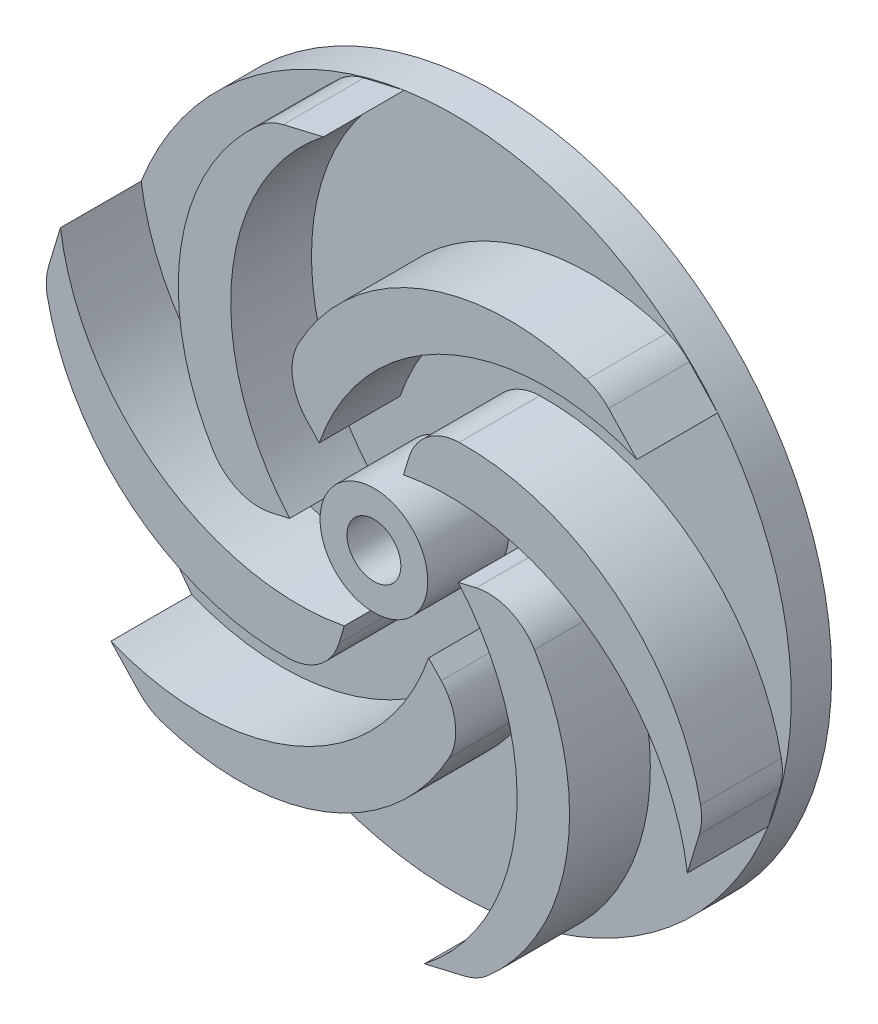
ISO-10303-21;
HEADER;
FILE_DESCRIPTION(('STEP AP214'),'2;1');
FILE_NAME('part.step','',(''),(''),'','','');
FILE_SCHEMA(('AUTOMOTIVE_DESIGN { 1 0 10303 214 1 1 1 1 }'));
ENDSEC;
DATA;
#1=APPLICATION_CONTEXT('core data for automotive mechanical design processes');
#2=APPLICATION_PROTOCOL_DEFINITION('international standard','automotive_design',2000,#1);
#3=PRODUCT_CONTEXT('',#1,'mechanical');
#4=PRODUCT('Part','Part','',(#3));
#5=PRODUCT_RELATED_PRODUCT_CATEGORY('part','',(#4));
#6=PRODUCT_DEFINITION_FORMATION('','',#4);
#7=PRODUCT_DEFINITION_CONTEXT('part definition',#1,'design');
#8=PRODUCT_DEFINITION('design','',#6,#7);
#9=PRODUCT_DEFINITION_SHAPE('','',#8);
#10=(LENGTH_UNIT() NAMED_UNIT(*) SI_UNIT(.MILLI.,.METRE.));
#11=(NAMED_UNIT(*) PLANE_ANGLE_UNIT() SI_UNIT($,.RADIAN.));
#12=(NAMED_UNIT(*) SI_UNIT($,.STERADIAN.) SOLID_ANGLE_UNIT());
#13=UNCERTAINTY_MEASURE_WITH_UNIT(LENGTH_MEASURE(1.E-05),#10,'distance_accuracy_value','');
#14=(GEOMETRIC_REPRESENTATION_CONTEXT(3) GLOBAL_UNCERTAINTY_ASSIGNED_CONTEXT((#13)) GLOBAL_UNIT_ASSIGNED_CONTEXT((#10,
#11,#12)) REPRESENTATION_CONTEXT('',''));
#15=CARTESIAN_POINT('',(0.,0.,0.));
#16=DIRECTION('',(0.,0.,1.));
#17=DIRECTION('',(1.,0.,0.));
#18=AXIS2_PLACEMENT_3D('',#15,#16,#17);
#19=CARTESIAN_POINT('',(0.,0.,1.5));
#20=DIRECTION('',(0.,0.,1.));
#21=DIRECTION('',(1.,0.,0.));
#22=AXIS2_PLACEMENT_3D('',#19,#20,#21);
#23=PLANE('',#22);
#24=CARTESIAN_POINT('',(0.,0.,1.5));
#25=DIRECTION('',(0.,0.,1.));
#26=DIRECTION('',(1.,0.,0.));
#27=AXIS2_PLACEMENT_3D('',#24,#25,#26);
#28=CIRCLE('',#27,2.);
#29=CARTESIAN_POINT('',(2.,0.,1.5));
#30=VERTEX_POINT('',#29);
#31=EDGE_CURVE('E454',#30,#30,#28,.T.);
#32=ORIENTED_EDGE('',*,*,#31,.F.);
#33=EDGE_LOOP('',(#32));
#34=FACE_BOUND('',#33,.T.);
#35=DIRECTION('',(0.973513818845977,0.228628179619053,0.));
#36=VECTOR('',#35,1.);
#37=CARTESIAN_POINT('',(-5.07749907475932,-0.994486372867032,1.5));
#38=LINE('',#37,#36);
#39=CARTESIAN_POINT('',(-3.79536522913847,-0.693379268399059,1.5));
#40=VERTEX_POINT('',#39);
#41=CARTESIAN_POINT('',(-3.13047143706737,-0.537230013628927,1.5));
#42=VERTEX_POINT('',#41);
#43=EDGE_CURVE('E303',#40,#42,#38,.T.);
#44=ORIENTED_EDGE('',*,*,#43,.F.);
#45=CARTESIAN_POINT('',(-4.25262158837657,1.2536483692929,1.5));
#46=DIRECTION('',(0.,0.,1.));
#47=DIRECTION('',(1.,0.,0.));
#48=AXIS2_PLACEMENT_3D('',#45,#46,#47);
#49=CIRCLE('',#48,2.);
#50=CARTESIAN_POINT('',(-5.96016080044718,0.212346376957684,1.5));
#51=VERTEX_POINT('',#50);
#52=EDGE_CURVE('E572',#40,#51,#49,.F.);
#53=ORIENTED_EDGE('',*,*,#52,.T.);
#54=CARTESIAN_POINT('',(1.65906908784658,4.85875168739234,1.5));
#55=DIRECTION('',(0.,0.,1.));
#56=DIRECTION('',(-1.,0.,0.));
#57=AXIS2_PLACEMENT_3D('',#54,#55,#56);
#58=CIRCLE('',#57,8.92422245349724);
#59=CARTESIAN_POINT('',(-4.23049564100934,11.5635838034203,1.5));
#60=VERTEX_POINT('',#59);
#61=EDGE_CURVE('E317',#60,#51,#58,.T.);
#62=ORIENTED_EDGE('',*,*,#61,.F.);
#63=CARTESIAN_POINT('',(-2.91059023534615,10.0609695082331,1.5));
#64=DIRECTION('',(0.,0.,1.));
#65=DIRECTION('',(1.,0.,0.));
#66=AXIS2_PLACEMENT_3D('',#63,#64,#65);
#67=CIRCLE('',#66,2.);
#68=CARTESIAN_POINT('',(-3.36784659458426,12.007997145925,1.5));
#69=VERTEX_POINT('',#68);
#70=EDGE_CURVE('E557',#60,#69,#67,.F.);
#71=ORIENTED_EDGE('',*,*,#70,.T.);
#72=DIRECTION('',(-0.973513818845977,-0.228628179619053,0.));
#73=VECTOR('',#72,1.);
#74=CARTESIAN_POINT('',(-3.82220625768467,11.9012914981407,1.5));
#75=LINE('',#74,#73);
#76=CARTESIAN_POINT('',(-1.87517861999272,12.3585478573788,1.5));
#77=VERTEX_POINT('',#76);
#78=EDGE_CURVE('E323',#77,#69,#75,.T.);
#79=ORIENTED_EDGE('',*,*,#78,.F.);
#80=CARTESIAN_POINT('',(0.,0.,1.5));
#81=DIRECTION('',(0.,0.,1.));
#82=DIRECTION('',(1.,0.,0.));
#83=AXIS2_PLACEMENT_3D('',#80,#81,#82);
#84=CIRCLE('',#83,12.5);
#85=CARTESIAN_POINT('',(-3.82220625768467,11.9012914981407,1.5));
#86=VERTEX_POINT('',#85);
#87=EDGE_CURVE('E618',#77,#86,#84,.T.);
#88=ORIENTED_EDGE('',*,*,#87,.T.);
#89=CARTESIAN_POINT('',(-11.6404057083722,4.55532160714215,1.5));
#90=VERTEX_POINT('',#89);
#91=EDGE_CURVE('E469',#86,#90,#84,.T.);
#92=ORIENTED_EDGE('',*,*,#91,.T.);
#93=CARTESIAN_POINT('',(-2.8007496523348,5.78097539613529,1.5));
#94=DIRECTION('',(0.,0.,-1.));
#95=DIRECTION('',(-1.,0.,0.));
#96=AXIS2_PLACEMENT_3D('',#93,#94,#95);
#97=CIRCLE('',#96,8.92422245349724);
#98=CARTESIAN_POINT('',(-1.09998087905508,-2.97968279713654,1.5));
#99=VERTEX_POINT('',#98);
#100=EDGE_CURVE('E342',#99,#90,#97,.T.);
#101=ORIENTED_EDGE('',*,*,#100,.F.);
#102=DIRECTION('',(0.288759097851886,0.957401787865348,0.));
#103=VECTOR('',#102,1.);
#104=CARTESIAN_POINT('',(-1.67749907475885,-4.89448637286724,1.5));
#105=LINE('',#104,#103);
#106=CARTESIAN_POINT('',(-1.29719855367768,-3.63357233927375,1.5));
#107=VERTEX_POINT('',#106);
#108=EDGE_CURVE('E340',#107,#99,#105,.T.);
#109=ORIENTED_EDGE('',*,*,#108,.F.);
#110=CARTESIAN_POINT('',(-3.21200212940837,-3.05605414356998,1.5));
#111=DIRECTION('',(0.,0.,1.));
#112=DIRECTION('',(1.,0.,0.));
#113=AXIS2_PLACEMENT_3D('',#110,#111,#112);
#114=CIRCLE('',#113,2.);
#115=CARTESIAN_POINT('',(-3.16397775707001,-5.05547747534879,1.5));
#116=VERTEX_POINT('',#115);
#117=EDGE_CURVE('E574',#107,#116,#114,.F.);
#118=ORIENTED_EDGE('',*,*,#117,.T.);
#119=CARTESIAN_POINT('',(-3.37826784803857,3.8661718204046,1.5));
#120=DIRECTION('',(0.,0.,1.));
#121=DIRECTION('',(-1.,0.,0.));
#122=AXIS2_PLACEMENT_3D('',#119,#120,#121);
#123=CIRCLE('',#122,8.92422245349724);
#124=CARTESIAN_POINT('',(-12.1296051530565,2.11807520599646,1.5));
#125=VERTEX_POINT('',#124);
#126=EDGE_CURVE('E307',#125,#116,#123,.T.);
#127=ORIENTED_EDGE('',*,*,#126,.F.);
#128=CARTESIAN_POINT('',(-10.1683502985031,2.50983967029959,1.5));
#129=DIRECTION('',(0.,0.,1.));
#130=DIRECTION('',(1.,0.,0.));
#131=AXIS2_PLACEMENT_3D('',#128,#129,#130);
#132=CIRCLE('',#131,2.);
#133=CARTESIAN_POINT('',(-12.0831538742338,3.08735786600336,1.5));
#134=VERTEX_POINT('',#133);
#135=EDGE_CURVE('E560',#125,#134,#132,.F.);
#136=ORIENTED_EDGE('',*,*,#135,.T.);
#137=DIRECTION('',(-0.288759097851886,-0.957401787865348,0.));
#138=VECTOR('',#137,1.);
#139=CARTESIAN_POINT('',(-12.2179239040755,2.64051803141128,1.5));
#140=LINE('',#139,#138);
#141=EDGE_CURVE('E330',#90,#134,#140,.T.);
#142=ORIENTED_EDGE('',*,*,#141,.F.);
#143=CARTESIAN_POINT('',(-12.2179239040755,2.64051803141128,1.5));
#144=VERTEX_POINT('',#143);
#145=EDGE_CURVE('E623',#90,#144,#84,.T.);
#146=ORIENTED_EDGE('',*,*,#145,.T.);
#147=CARTESIAN_POINT('',(-9.76522708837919,-7.80322625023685,1.5));
#148=VERTEX_POINT('',#147);
#149=EDGE_CURVE('E620',#144,#148,#84,.T.);
#150=ORIENTED_EDGE('',*,*,#149,.T.);
#151=CARTESIAN_POINT('',(-6.40684637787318,0.464967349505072,1.5));
#152=DIRECTION('',(0.,0.,-1.));
#153=DIRECTION('',(-1.,0.,0.));
#154=AXIS2_PLACEMENT_3D('',#151,#152,#153);
#155=CIRCLE('',#154,8.92422245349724);
#156=CARTESIAN_POINT('',(2.03049055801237,-2.44245278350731,1.5));
#157=VERTEX_POINT('',#156);
#158=EDGE_CURVE('E368',#157,#148,#155,.T.);
#159=ORIENTED_EDGE('',*,*,#158,.F.);
#160=DIRECTION('',(-0.684754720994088,0.728773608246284,0.));
#161=VECTOR('',#160,1.);
#162=CARTESIAN_POINT('',(3.40000000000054,-3.89999999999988,1.5));
#163=LINE('',#162,#161);
#164=CARTESIAN_POINT('',(2.49816667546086,-2.94019307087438,1.5));
#165=VERTEX_POINT('',#164);
#166=EDGE_CURVE('E366',#165,#157,#163,.T.);
#167=ORIENTED_EDGE('',*,*,#166,.F.);
#168=CARTESIAN_POINT('',(1.04061945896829,-4.30970251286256,1.5));
#169=DIRECTION('',(0.,0.,1.));
#170=DIRECTION('',(1.,0.,0.));
#171=AXIS2_PLACEMENT_3D('',#168,#169,#170);
#172=CIRCLE('',#171,2.);
#173=CARTESIAN_POINT('',(2.79618304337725,-5.26782385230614,1.5));
#174=VERTEX_POINT('',#173);
#175=EDGE_CURVE('E576',#165,#174,#172,.F.);
#176=ORIENTED_EDGE('',*,*,#175,.T.);
#177=CARTESIAN_POINT('',(-5.03733693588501,-0.992579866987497,1.5));
#178=DIRECTION('',(0.,0.,1.));
#179=DIRECTION('',(-1.,0.,0.));
#180=AXIS2_PLACEMENT_3D('',#177,#178,#179);
#181=CIRCLE('',#180,8.92422245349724);
#182=CARTESIAN_POINT('',(-7.89910951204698,-9.44550859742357,1.5));
#183=VERTEX_POINT('',#182);
#184=EDGE_CURVE('E351',#183,#174,#181,.T.);
#185=ORIENTED_EDGE('',*,*,#184,.F.);
#186=CARTESIAN_POINT('',(-7.25776006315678,-7.55112983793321,1.5));
#187=DIRECTION('',(0.,0.,1.));
#188=DIRECTION('',(1.,0.,0.));
#189=AXIS2_PLACEMENT_3D('',#186,#187,#188);
#190=CIRCLE('',#189,2.);
#191=CARTESIAN_POINT('',(-8.71530727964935,-8.92063927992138,1.5));
#192=VERTEX_POINT('',#191);
#193=EDGE_CURVE('E563',#183,#192,#190,.F.);
#194=ORIENTED_EDGE('',*,*,#193,.T.);
#195=DIRECTION('',(0.684754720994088,-0.728773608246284,0.));
#196=VECTOR('',#195,1.);
#197=CARTESIAN_POINT('',(-8.39571764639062,-9.26077346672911,1.5));
#198=LINE('',#197,#196);
#199=EDGE_CURVE('E356',#148,#192,#198,.T.);
#200=ORIENTED_EDGE('',*,*,#199,.F.);
#201=CARTESIAN_POINT('',(-8.39571764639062,-9.26077346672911,1.5));
#202=VERTEX_POINT('',#201);
#203=EDGE_CURVE('E616',#148,#202,#84,.T.);
#204=ORIENTED_EDGE('',*,*,#203,.T.);
#205=CARTESIAN_POINT('',(1.87517861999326,-12.3585478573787,1.5));
#206=VERTEX_POINT('',#205);
#207=EDGE_CURVE('E626',#202,#206,#84,.T.);
#208=ORIENTED_EDGE('',*,*,#207,.T.);
#209=CARTESIAN_POINT('',(-3.60609672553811,-5.31600804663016,1.5));
#210=DIRECTION('',(0.,0.,-1.));
#211=DIRECTION('',(-1.,0.,0.));
#212=AXIS2_PLACEMENT_3D('',#209,#210,#211);
#213=CIRCLE('',#212,8.92422245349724);
#214=CARTESIAN_POINT('',(3.13047143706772,0.537230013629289,1.5));
#215=VERTEX_POINT('',#214);
#216=EDGE_CURVE('E393',#215,#206,#213,.T.);
#217=ORIENTED_EDGE('',*,*,#216,.F.);
#218=DIRECTION('',(-0.973513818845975,-0.228628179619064,0.));
#219=VECTOR('',#218,1.);
#220=CARTESIAN_POINT('',(5.07749907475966,0.994486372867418,1.5));
#221=LINE('',#220,#219);
#222=CARTESIAN_POINT('',(3.79536522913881,0.693379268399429,1.5));
#223=VERTEX_POINT('',#222);
#224=EDGE_CURVE('E391',#223,#215,#221,.T.);
#225=ORIENTED_EDGE('',*,*,#224,.F.);
#226=CARTESIAN_POINT('',(4.25262158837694,-1.25364836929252,1.5));
#227=DIRECTION('',(0.,0.,1.));
#228=DIRECTION('',(1.,0.,0.));
#229=AXIS2_PLACEMENT_3D('',#226,#227,#228);
#230=CIRCLE('',#229,2.);
#231=CARTESIAN_POINT('',(5.96016080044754,-0.212346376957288,1.5));
#232=VERTEX_POINT('',#231);
#233=EDGE_CURVE('E11',#223,#232,#230,.F.);
#234=ORIENTED_EDGE('',*,*,#233,.T.);
#235=CARTESIAN_POINT('',(-1.65906908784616,-4.85875168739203,1.5));
#236=DIRECTION('',(0.,0.,1.));
#237=DIRECTION('',(-1.,0.,0.));
#238=AXIS2_PLACEMENT_3D('',#235,#236,#237);
#239=CIRCLE('',#238,8.92422245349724);
#240=CARTESIAN_POINT('',(4.23049564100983,-11.56358380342,1.5));
#241=VERTEX_POINT('',#240);
#242=EDGE_CURVE('E377',#241,#232,#239,.T.);
#243=ORIENTED_EDGE('',*,*,#242,.F.);
#244=CARTESIAN_POINT('',(2.91059023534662,-10.0609695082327,1.5));
#245=DIRECTION('',(0.,0.,1.));
#246=DIRECTION('',(1.,0.,0.));
#247=AXIS2_PLACEMENT_3D('',#244,#245,#246);
#248=CIRCLE('',#247,2.);
#249=CARTESIAN_POINT('',(3.36784659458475,-12.0079971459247,1.5));
#250=VERTEX_POINT('',#249);
#251=EDGE_CURVE('E566',#241,#250,#248,.F.);
#252=ORIENTED_EDGE('',*,*,#251,.T.);
#253=DIRECTION('',(0.973513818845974,0.228628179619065,0.));
#254=VECTOR('',#253,1.);
#255=CARTESIAN_POINT('',(3.82220625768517,-11.9012914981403,1.5));
#256=LINE('',#255,#254);
#257=EDGE_CURVE('E56',#206,#250,#256,.T.);
#258=ORIENTED_EDGE('',*,*,#257,.F.);
#259=CARTESIAN_POINT('',(3.82220625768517,-11.9012914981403,1.5));
#260=VERTEX_POINT('',#259);
#261=EDGE_CURVE('E615',#206,#260,#84,.T.);
#262=ORIENTED_EDGE('',*,*,#261,.T.);
#263=CARTESIAN_POINT('',(11.6404057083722,-4.55532160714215,1.5));
#264=VERTEX_POINT('',#263);
#265=EDGE_CURVE('E613',#260,#264,#84,.T.);
#266=ORIENTED_EDGE('',*,*,#265,.T.);
#267=CARTESIAN_POINT('',(2.80074965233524,-5.78097539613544,1.5));
#268=DIRECTION('',(0.,0.,-1.));
#269=DIRECTION('',(-1.,0.,0.));
#270=AXIS2_PLACEMENT_3D('',#267,#268,#269);
#271=CIRCLE('',#270,8.92422245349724);
#272=CARTESIAN_POINT('',(1.09998087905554,2.97968279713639,1.5));
#273=VERTEX_POINT('',#272);
#274=EDGE_CURVE('E417',#273,#264,#271,.T.);
#275=ORIENTED_EDGE('',*,*,#274,.F.);
#276=DIRECTION('',(-0.288759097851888,-0.957401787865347,0.));
#277=VECTOR('',#276,1.);
#278=CARTESIAN_POINT('',(1.67749907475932,4.89448637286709,1.5));
#279=LINE('',#278,#277);
#280=CARTESIAN_POINT('',(1.29719855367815,3.6335723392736,1.5));
#281=VERTEX_POINT('',#280);
#282=EDGE_CURVE('E415',#281,#273,#279,.T.);
#283=ORIENTED_EDGE('',*,*,#282,.F.);
#284=CARTESIAN_POINT('',(3.21200212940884,3.05605414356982,1.5));
#285=DIRECTION('',(0.,0.,1.));
#286=DIRECTION('',(1.,0.,0.));
#287=AXIS2_PLACEMENT_3D('',#284,#285,#286);
#288=CIRCLE('',#287,2.);
#289=CARTESIAN_POINT('',(3.16397775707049,5.05547747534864,1.5));
#290=VERTEX_POINT('',#289);
#291=EDGE_CURVE('E41',#281,#290,#288,.F.);
#292=ORIENTED_EDGE('',*,*,#291,.T.);
#293=CARTESIAN_POINT('',(3.37826784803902,-3.86617182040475,1.5));
#294=DIRECTION('',(0.,0.,1.));
#295=DIRECTION('',(-1.,0.,0.));
#296=AXIS2_PLACEMENT_3D('',#293,#294,#295);
#297=CIRCLE('',#296,8.92422245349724);
#298=CARTESIAN_POINT('',(12.129605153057,-2.11807520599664,1.5));
#299=VERTEX_POINT('',#298);
#300=EDGE_CURVE('E401',#299,#290,#297,.T.);
#301=ORIENTED_EDGE('',*,*,#300,.F.);
#302=CARTESIAN_POINT('',(10.1683502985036,-2.50983967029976,1.5));
#303=DIRECTION('',(0.,0.,1.));
#304=DIRECTION('',(1.,0.,0.));
#305=AXIS2_PLACEMENT_3D('',#302,#303,#304);
#306=CIRCLE('',#305,2.);
#307=CARTESIAN_POINT('',(12.0831538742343,-3.08735786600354,1.5));
#308=VERTEX_POINT('',#307);
#309=EDGE_CURVE('E568',#299,#308,#306,.F.);
#310=ORIENTED_EDGE('',*,*,#309,.T.);
#311=DIRECTION('',(0.288759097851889,0.957401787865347,0.));
#312=VECTOR('',#311,1.);
#313=CARTESIAN_POINT('',(12.217923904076,-2.64051803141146,1.5));
#314=LINE('',#313,#312);
#315=EDGE_CURVE('E48',#264,#308,#314,.T.);
#316=ORIENTED_EDGE('',*,*,#315,.F.);
#317=CARTESIAN_POINT('',(12.217923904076,-2.64051803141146,1.5));
#318=VERTEX_POINT('',#317);
#319=EDGE_CURVE('E607',#264,#318,#84,.T.);
#320=ORIENTED_EDGE('',*,*,#319,.T.);
#321=CARTESIAN_POINT('',(9.76522708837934,7.80322625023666,1.5));
#322=VERTEX_POINT('',#321);
#323=EDGE_CURVE('E472',#318,#322,#84,.T.);
#324=ORIENTED_EDGE('',*,*,#323,.T.);
#325=CARTESIAN_POINT('',(6.40684637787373,-0.464967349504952,1.5));
#326=DIRECTION('',(0.,0.,-1.));
#327=DIRECTION('',(-1.,0.,0.));
#328=AXIS2_PLACEMENT_3D('',#325,#326,#327);
#329=CIRCLE('',#328,8.92422245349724);
#330=CARTESIAN_POINT('',(-2.03049055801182,2.44245278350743,1.5));
#331=VERTEX_POINT('',#330);
#332=EDGE_CURVE('E442',#331,#322,#329,.T.);
#333=ORIENTED_EDGE('',*,*,#332,.F.);
#334=DIRECTION('',(0.684754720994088,-0.728773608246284,0.));
#335=VECTOR('',#334,1.);
#336=CARTESIAN_POINT('',(-3.4,3.9,1.5));
#337=LINE('',#336,#335);
#338=CARTESIAN_POINT('',(-2.49816667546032,2.9401930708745,1.5));
#339=VERTEX_POINT('',#338);
#340=EDGE_CURVE('E440',#339,#331,#337,.T.);
#341=ORIENTED_EDGE('',*,*,#340,.F.);
#342=CARTESIAN_POINT('',(-1.04061945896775,4.30970251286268,1.5));
#343=DIRECTION('',(0.,0.,1.));
#344=DIRECTION('',(1.,0.,0.));
#345=AXIS2_PLACEMENT_3D('',#342,#343,#344);
#346=CIRCLE('',#345,2.);
#347=CARTESIAN_POINT('',(-2.79618304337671,5.26782385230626,1.5));
#348=VERTEX_POINT('',#347);
#349=EDGE_CURVE('E570',#339,#348,#346,.F.);
#350=ORIENTED_EDGE('',*,*,#349,.T.);
#351=CARTESIAN_POINT('',(5.03733693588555,0.992579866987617,1.5));
#352=DIRECTION('',(0.,0.,1.));
#353=DIRECTION('',(-1.,0.,0.));
#354=AXIS2_PLACEMENT_3D('',#351,#352,#353);
#355=CIRCLE('',#354,8.92422245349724);
#356=CARTESIAN_POINT('',(7.89910951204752,9.44550859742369,1.5));
#357=VERTEX_POINT('',#356);
#358=EDGE_CURVE('E425',#357,#348,#355,.T.);
#359=ORIENTED_EDGE('',*,*,#358,.F.);
#360=CARTESIAN_POINT('',(7.25776006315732,7.55112983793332,1.5));
#361=DIRECTION('',(0.,0.,1.));
#362=DIRECTION('',(1.,0.,0.));
#363=AXIS2_PLACEMENT_3D('',#360,#361,#362);
#364=CIRCLE('',#363,2.);
#365=CARTESIAN_POINT('',(8.7153072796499,8.9206392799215,1.5));
#366=VERTEX_POINT('',#365);
#367=EDGE_CURVE('E554',#357,#366,#364,.F.);
#368=ORIENTED_EDGE('',*,*,#367,.T.);
#369=DIRECTION('',(-0.684754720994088,0.728773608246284,0.));
#370=VECTOR('',#369,1.);
#371=CARTESIAN_POINT('',(8.39571764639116,9.26077346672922,1.5));
#372=LINE('',#371,#370);
#373=EDGE_CURVE('E430',#322,#366,#372,.T.);
#374=ORIENTED_EDGE('',*,*,#373,.F.);
#375=CARTESIAN_POINT('',(8.39571764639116,9.26077346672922,1.5));
#376=VERTEX_POINT('',#375);
#377=EDGE_CURVE('E464',#322,#376,#84,.T.);
#378=ORIENTED_EDGE('',*,*,#377,.T.);
#379=EDGE_CURVE('E468',#376,#77,#84,.T.);
#380=ORIENTED_EDGE('',*,*,#379,.T.);
#381=CARTESIAN_POINT('',(3.60609672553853,5.31600804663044,1.5));
#382=DIRECTION('',(0.,0.,-1.));
#383=DIRECTION('',(-1.,0.,0.));
#384=AXIS2_PLACEMENT_3D('',#381,#382,#383);
#385=CIRCLE('',#384,8.92422245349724);
#386=EDGE_CURVE('E321',#42,#77,#385,.T.);
#387=ORIENTED_EDGE('',*,*,#386,.F.);
#388=EDGE_LOOP('',(#44,#53,#62,#71,#79,#88,#92,#101,#109,#118,#127,#136,#142,#146,#150,#159,
#167,#176,#185,#194,#200,#204,#208,#217,#225,#234,#243,#252,#258,#262,#266,#275,#283,#292,#301,
#310,#316,#320,#324,#333,#341,#350,#359,#368,#374,#378,#380,#387));
#389=FACE_BOUND('',#388,.T.);
#390=ADVANCED_FACE('F33',(#34,#389),#23,.T.);
#391=CARTESIAN_POINT('',(0.,0.,0.));
#392=DIRECTION('',(0.,0.,1.));
#393=DIRECTION('',(1.,0.,0.));
#394=AXIS2_PLACEMENT_3D('',#391,#392,#393);
#395=PLANE('',#394);
#396=CARTESIAN_POINT('',(0.,0.,0.));
#397=DIRECTION('',(0.,0.,1.));
#398=DIRECTION('',(1.,0.,0.));
#399=AXIS2_PLACEMENT_3D('',#396,#397,#398);
#400=CIRCLE('',#399,12.5);
#401=CARTESIAN_POINT('',(12.5,0.,0.));
#402=VERTEX_POINT('',#401);
#403=EDGE_CURVE('E463',#402,#402,#400,.T.);
#404=ORIENTED_EDGE('',*,*,#403,.F.);
#405=EDGE_LOOP('',(#404));
#406=FACE_BOUND('',#405,.T.);
#407=CARTESIAN_POINT('',(0.,0.,0.));
#408=DIRECTION('',(0.,0.,1.));
#409=DIRECTION('',(1.,0.,0.));
#410=AXIS2_PLACEMENT_3D('',#407,#408,#409);
#411=CIRCLE('',#410,1.);
#412=CARTESIAN_POINT('',(1.,0.,0.));
#413=VERTEX_POINT('',#412);
#414=EDGE_CURVE('E458',#413,#413,#411,.T.);
#415=ORIENTED_EDGE('',*,*,#414,.T.);
#416=EDGE_LOOP('',(#415));
#417=FACE_BOUND('',#416,.T.);
#418=ADVANCED_FACE('F690',(#406,#417),#395,.F.);
#419=CARTESIAN_POINT('',(0.,0.,1.5));
#420=DIRECTION('',(0.,0.,-1.));
#421=DIRECTION('',(-1.,0.,0.));
#422=AXIS2_PLACEMENT_3D('',#419,#420,#421);
#423=CYLINDRICAL_SURFACE('',#422,12.5);
#424=ORIENTED_EDGE('',*,*,#377,.F.);
#425=ORIENTED_EDGE('',*,*,#323,.F.);
#426=ORIENTED_EDGE('',*,*,#319,.F.);
#427=ORIENTED_EDGE('',*,*,#265,.F.);
#428=ORIENTED_EDGE('',*,*,#261,.F.);
#429=ORIENTED_EDGE('',*,*,#207,.F.);
#430=ORIENTED_EDGE('',*,*,#203,.F.);
#431=ORIENTED_EDGE('',*,*,#149,.F.);
#432=ORIENTED_EDGE('',*,*,#145,.F.);
#433=ORIENTED_EDGE('',*,*,#91,.F.);
#434=ORIENTED_EDGE('',*,*,#87,.F.);
#435=ORIENTED_EDGE('',*,*,#379,.F.);
#436=EDGE_LOOP('',(#424,#425,#426,#427,#428,#429,#430,#431,#432,#433,#434,#435));
#437=FACE_BOUND('',#436,.T.);
#438=ORIENTED_EDGE('',*,*,#403,.T.);
#439=EDGE_LOOP('',(#438));
#440=FACE_BOUND('',#439,.T.);
#441=ADVANCED_FACE('F610',(#437,#440),#423,.T.);
#442=CARTESIAN_POINT('',(0.,0.,1.5));
#443=DIRECTION('',(0.,0.,-1.));
#444=DIRECTION('',(-1.,0.,0.));
#445=AXIS2_PLACEMENT_3D('',#442,#443,#444);
#446=CYLINDRICAL_SURFACE('',#445,1.);
#447=ORIENTED_EDGE('',*,*,#414,.F.);
#448=EDGE_LOOP('',(#447));
#449=FACE_BOUND('',#448,.T.);
#450=CARTESIAN_POINT('',(0.,0.,4.5));
#451=DIRECTION('',(0.,0.,1.));
#452=DIRECTION('',(1.,0.,0.));
#453=AXIS2_PLACEMENT_3D('',#450,#451,#452);
#454=CIRCLE('',#453,1.);
#455=CARTESIAN_POINT('',(1.,0.,4.5));
#456=VERTEX_POINT('',#455);
#457=EDGE_CURVE('E451',#456,#456,#454,.T.);
#458=ORIENTED_EDGE('',*,*,#457,.T.);
#459=EDGE_LOOP('',(#458));
#460=FACE_BOUND('',#459,.T.);
#461=ADVANCED_FACE('F702',(#449,#460),#446,.F.);
#462=CARTESIAN_POINT('',(0.,0.,4.5));
#463=DIRECTION('',(0.,0.,1.));
#464=DIRECTION('',(1.,0.,0.));
#465=AXIS2_PLACEMENT_3D('',#462,#463,#464);
#466=PLANE('',#465);
#467=CARTESIAN_POINT('',(0.,0.,4.5));
#468=DIRECTION('',(0.,0.,1.));
#469=DIRECTION('',(1.,0.,0.));
#470=AXIS2_PLACEMENT_3D('',#467,#468,#469);
#471=CIRCLE('',#470,2.);
#472=CARTESIAN_POINT('',(2.,0.,4.5));
#473=VERTEX_POINT('',#472);
#474=EDGE_CURVE('E455',#473,#473,#471,.T.);
#475=ORIENTED_EDGE('',*,*,#474,.T.);
#476=EDGE_LOOP('',(#475));
#477=FACE_BOUND('',#476,.T.);
#478=ORIENTED_EDGE('',*,*,#457,.F.);
#479=EDGE_LOOP('',(#478));
#480=FACE_BOUND('',#479,.T.);
#481=ADVANCED_FACE('F710',(#477,#480),#466,.T.);
#482=CARTESIAN_POINT('',(0.,0.,4.5));
#483=DIRECTION('',(0.,0.,-1.));
#484=DIRECTION('',(-1.,0.,0.));
#485=AXIS2_PLACEMENT_3D('',#482,#483,#484);
#486=CYLINDRICAL_SURFACE('',#485,2.);
#487=ORIENTED_EDGE('',*,*,#474,.F.);
#488=EDGE_LOOP('',(#487));
#489=FACE_BOUND('',#488,.T.);
#490=ORIENTED_EDGE('',*,*,#31,.T.);
#491=EDGE_LOOP('',(#490));
#492=FACE_BOUND('',#491,.T.);
#493=ADVANCED_FACE('F715',(#489,#492),#486,.T.);
#494=CARTESIAN_POINT('',(5.03733693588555,0.992579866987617,4.5));
#495=DIRECTION('',(0.,0.,-1.));
#496=DIRECTION('',(-1.,0.,0.));
#497=AXIS2_PLACEMENT_3D('',#494,#495,#496);
#498=CYLINDRICAL_SURFACE('',#497,8.92422245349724);
#499=CARTESIAN_POINT('',(5.03733693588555,0.992579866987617,4.5));
#500=DIRECTION('',(0.,0.,1.));
#501=DIRECTION('',(-1.,0.,0.));
#502=AXIS2_PLACEMENT_3D('',#499,#500,#501);
#503=CIRCLE('',#502,8.92422245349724);
#504=CARTESIAN_POINT('',(7.89910951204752,9.44550859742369,4.5));
#505=VERTEX_POINT('',#504);
#506=CARTESIAN_POINT('',(-2.79618304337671,5.26782385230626,4.5));
#507=VERTEX_POINT('',#506);
#508=EDGE_CURVE('E426',#505,#507,#503,.T.);
#509=ORIENTED_EDGE('',*,*,#508,.F.);
#510=DIRECTION('',(0.,0.,-1.));
#511=VECTOR('',#510,1.);
#512=CARTESIAN_POINT('',(7.89910951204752,9.44550859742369,4.5));
#513=LINE('',#512,#511);
#514=EDGE_CURVE('E474',#505,#357,#513,.T.);
#515=ORIENTED_EDGE('',*,*,#514,.T.);
#516=ORIENTED_EDGE('',*,*,#358,.T.);
#517=DIRECTION('',(0.,0.,-1.));
#518=VECTOR('',#517,1.);
#519=CARTESIAN_POINT('',(-2.79618304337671,5.26782385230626,4.5));
#520=LINE('',#519,#518);
#521=EDGE_CURVE('E467',#348,#507,#520,.F.);
#522=ORIENTED_EDGE('',*,*,#521,.T.);
#523=EDGE_LOOP('',(#509,#515,#516,#522));
#524=FACE_BOUND('',#523,.T.);
#525=ADVANCED_FACE('F668',(#524),#498,.T.);
#526=CARTESIAN_POINT('',(-3.4,3.9,4.5));
#527=DIRECTION('',(0.728773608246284,0.684754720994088,0.));
#528=DIRECTION('',(-0.684754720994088,0.728773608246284,0.));
#529=AXIS2_PLACEMENT_3D('',#526,#527,#528);
#530=PLANE('',#529);
#531=DIRECTION('',(0.684754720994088,-0.728773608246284,0.));
#532=VECTOR('',#531,1.);
#533=CARTESIAN_POINT('',(-3.4,3.9,4.5));
#534=LINE('',#533,#532);
#535=CARTESIAN_POINT('',(-2.49816667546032,2.9401930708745,4.5));
#536=VERTEX_POINT('',#535);
#537=CARTESIAN_POINT('',(-2.03049055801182,2.44245278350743,4.5));
#538=VERTEX_POINT('',#537);
#539=EDGE_CURVE('E429',#536,#538,#534,.T.);
#540=ORIENTED_EDGE('',*,*,#539,.F.);
#541=DIRECTION('',(0.,0.,-1.));
#542=VECTOR('',#541,1.);
#543=CARTESIAN_POINT('',(-2.49816667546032,2.9401930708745,4.5));
#544=LINE('',#543,#542);
#545=EDGE_CURVE('E537',#536,#339,#544,.T.);
#546=ORIENTED_EDGE('',*,*,#545,.T.);
#547=ORIENTED_EDGE('',*,*,#340,.T.);
#548=DIRECTION('',(0.,0.,-1.));
#549=VECTOR('',#548,1.);
#550=CARTESIAN_POINT('',(-2.03049055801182,2.44245278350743,4.5));
#551=LINE('',#550,#549);
#552=EDGE_CURVE('E448',#538,#331,#551,.T.);
#553=ORIENTED_EDGE('',*,*,#552,.F.);
#554=EDGE_LOOP('',(#540,#546,#547,#553));
#555=FACE_BOUND('',#554,.T.);
#556=ADVANCED_FACE('F660',(#555),#530,.F.);
#557=CARTESIAN_POINT('',(6.40684637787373,-0.464967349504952,4.5));
#558=DIRECTION('',(0.,0.,-1.));
#559=DIRECTION('',(-1.,0.,0.));
#560=AXIS2_PLACEMENT_3D('',#557,#558,#559);
#561=CYLINDRICAL_SURFACE('',#560,8.92422245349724);
#562=ORIENTED_EDGE('',*,*,#332,.T.);
#563=DIRECTION('',(0.,0.,-1.));
#564=VECTOR('',#563,1.);
#565=CARTESIAN_POINT('',(9.76522708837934,7.80322625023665,4.5));
#566=LINE('',#565,#564);
#567=CARTESIAN_POINT('',(9.76522708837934,7.80322625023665,4.5));
#568=VERTEX_POINT('',#567);
#569=EDGE_CURVE('E437',#568,#322,#566,.T.);
#570=ORIENTED_EDGE('',*,*,#569,.F.);
#571=CARTESIAN_POINT('',(6.40684637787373,-0.464967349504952,4.5));
#572=DIRECTION('',(0.,0.,-1.));
#573=DIRECTION('',(-1.,0.,0.));
#574=AXIS2_PLACEMENT_3D('',#571,#572,#573);
#575=CIRCLE('',#574,8.92422245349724);
#576=EDGE_CURVE('E432',#538,#568,#575,.T.);
#577=ORIENTED_EDGE('',*,*,#576,.F.);
#578=ORIENTED_EDGE('',*,*,#552,.T.);
#579=EDGE_LOOP('',(#562,#570,#577,#578));
#580=FACE_BOUND('',#579,.T.);
#581=ADVANCED_FACE('F655',(#580),#561,.F.);
#582=CARTESIAN_POINT('',(8.39571764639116,9.26077346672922,4.5));
#583=DIRECTION('',(-0.728773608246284,-0.684754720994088,0.));
#584=DIRECTION('',(0.684754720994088,-0.728773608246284,0.));
#585=AXIS2_PLACEMENT_3D('',#582,#583,#584);
#586=PLANE('',#585);
#587=ORIENTED_EDGE('',*,*,#373,.T.);
#588=DIRECTION('',(0.,0.,-1.));
#589=VECTOR('',#588,1.);
#590=CARTESIAN_POINT('',(8.7153072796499,8.9206392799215,4.5));
#591=LINE('',#590,#589);
#592=CARTESIAN_POINT('',(8.7153072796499,8.9206392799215,4.5));
#593=VERTEX_POINT('',#592);
#594=EDGE_CURVE('E477',#366,#593,#591,.F.);
#595=ORIENTED_EDGE('',*,*,#594,.T.);
#596=DIRECTION('',(-0.684754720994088,0.728773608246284,0.));
#597=VECTOR('',#596,1.);
#598=CARTESIAN_POINT('',(8.39571764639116,9.26077346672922,4.5));
#599=LINE('',#598,#597);
#600=EDGE_CURVE('E434',#568,#593,#599,.T.);
#601=ORIENTED_EDGE('',*,*,#600,.F.);
#602=ORIENTED_EDGE('',*,*,#569,.T.);
#603=EDGE_LOOP('',(#587,#595,#601,#602));
#604=FACE_BOUND('',#603,.T.);
#605=ADVANCED_FACE('F649',(#604),#586,.F.);
#606=CARTESIAN_POINT('',(5.03733693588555,0.992579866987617,4.5));
#607=DIRECTION('',(0.,0.,-1.));
#608=DIRECTION('',(-1.,0.,0.));
#609=AXIS2_PLACEMENT_3D('',#606,#607,#608);
#610=PLANE('',#609);
#611=ORIENTED_EDGE('',*,*,#600,.T.);
#612=CARTESIAN_POINT('',(7.25776006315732,7.55112983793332,4.5));
#613=DIRECTION('',(0.,0.,-1.));
#614=DIRECTION('',(-1.,0.,0.));
#615=AXIS2_PLACEMENT_3D('',#612,#613,#614);
#616=CIRCLE('',#615,2.);
#617=EDGE_CURVE('E481',#593,#505,#616,.F.);
#618=ORIENTED_EDGE('',*,*,#617,.T.);
#619=ORIENTED_EDGE('',*,*,#508,.T.);
#620=CARTESIAN_POINT('',(-1.04061945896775,4.30970251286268,4.5));
#621=DIRECTION('',(0.,0.,-1.));
#622=DIRECTION('',(-1.,0.,0.));
#623=AXIS2_PLACEMENT_3D('',#620,#621,#622);
#624=CIRCLE('',#623,2.);
#625=EDGE_CURVE('E479',#507,#536,#624,.F.);
#626=ORIENTED_EDGE('',*,*,#625,.T.);
#627=ORIENTED_EDGE('',*,*,#539,.T.);
#628=ORIENTED_EDGE('',*,*,#576,.T.);
#629=EDGE_LOOP('',(#611,#618,#619,#626,#627,#628));
#630=FACE_BOUND('',#629,.T.);
#631=ADVANCED_FACE('F671',(#630),#610,.F.);
#632=CARTESIAN_POINT('',(3.37826784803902,-3.86617182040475,4.5));
#633=DIRECTION('',(0.,0.,-1.));
#634=DIRECTION('',(-1.,0.,0.));
#635=AXIS2_PLACEMENT_3D('',#632,#633,#634);
#636=CYLINDRICAL_SURFACE('',#635,8.92422245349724);
#637=CARTESIAN_POINT('',(3.37826784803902,-3.86617182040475,4.5));
#638=DIRECTION('',(0.,0.,1.));
#639=DIRECTION('',(-1.,0.,0.));
#640=AXIS2_PLACEMENT_3D('',#637,#638,#639);
#641=CIRCLE('',#640,8.92422245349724);
#642=CARTESIAN_POINT('',(12.129605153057,-2.11807520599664,4.5));
#643=VERTEX_POINT('',#642);
#644=CARTESIAN_POINT('',(3.16397775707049,5.05547747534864,4.5));
#645=VERTEX_POINT('',#644);
#646=EDGE_CURVE('E402',#643,#645,#641,.T.);
#647=ORIENTED_EDGE('',*,*,#646,.F.);
#648=DIRECTION('',(0.,0.,-1.));
#649=VECTOR('',#648,1.);
#650=CARTESIAN_POINT('',(12.129605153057,-2.11807520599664,4.5));
#651=LINE('',#650,#649);
#652=EDGE_CURVE('E528',#643,#299,#651,.T.);
#653=ORIENTED_EDGE('',*,*,#652,.T.);
#654=ORIENTED_EDGE('',*,*,#300,.T.);
#655=DIRECTION('',(0.,0.,-1.));
#656=VECTOR('',#655,1.);
#657=CARTESIAN_POINT('',(3.16397775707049,5.05547747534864,4.5));
#658=LINE('',#657,#656);
#659=EDGE_CURVE('E526',#290,#645,#658,.F.);
#660=ORIENTED_EDGE('',*,*,#659,.T.);
#661=EDGE_LOOP('',(#647,#653,#654,#660));
#662=FACE_BOUND('',#661,.T.);
#663=ADVANCED_FACE('F586',(#662),#636,.T.);
#664=CARTESIAN_POINT('',(1.67749907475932,4.89448637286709,4.5));
#665=DIRECTION('',(0.957401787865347,-0.288759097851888,0.));
#666=DIRECTION('',(0.288759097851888,0.957401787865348,0.));
#667=AXIS2_PLACEMENT_3D('',#664,#665,#666);
#668=PLANE('',#667);
#669=DIRECTION('',(-0.288759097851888,-0.957401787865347,0.));
#670=VECTOR('',#669,1.);
#671=CARTESIAN_POINT('',(1.67749907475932,4.89448637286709,4.5));
#672=LINE('',#671,#670);
#673=CARTESIAN_POINT('',(1.29719855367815,3.6335723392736,4.5));
#674=VERTEX_POINT('',#673);
#675=CARTESIAN_POINT('',(1.09998087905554,2.97968279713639,4.5));
#676=VERTEX_POINT('',#675);
#677=EDGE_CURVE('E405',#674,#676,#672,.T.);
#678=ORIENTED_EDGE('',*,*,#677,.F.);
#679=DIRECTION('',(0.,0.,-1.));
#680=VECTOR('',#679,1.);
#681=CARTESIAN_POINT('',(1.29719855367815,3.6335723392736,4.5));
#682=LINE('',#681,#680);
#683=EDGE_CURVE('E548',#674,#281,#682,.T.);
#684=ORIENTED_EDGE('',*,*,#683,.T.);
#685=ORIENTED_EDGE('',*,*,#282,.T.);
#686=DIRECTION('',(0.,0.,-1.));
#687=VECTOR('',#686,1.);
#688=CARTESIAN_POINT('',(1.09998087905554,2.97968279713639,4.5));
#689=LINE('',#688,#687);
#690=EDGE_CURVE('E422',#676,#273,#689,.T.);
#691=ORIENTED_EDGE('',*,*,#690,.F.);
#692=EDGE_LOOP('',(#678,#684,#685,#691));
#693=FACE_BOUND('',#692,.T.);
#694=ADVANCED_FACE('F595',(#693),#668,.F.);
#695=CARTESIAN_POINT('',(2.80074965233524,-5.78097539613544,4.5));
#696=DIRECTION('',(0.,0.,-1.));
#697=DIRECTION('',(-1.,0.,0.));
#698=AXIS2_PLACEMENT_3D('',#695,#696,#697);
#699=CYLINDRICAL_SURFACE('',#698,8.92422245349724);
#700=ORIENTED_EDGE('',*,*,#274,.T.);
#701=DIRECTION('',(0.,0.,-1.));
#702=VECTOR('',#701,1.);
#703=CARTESIAN_POINT('',(11.6404057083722,-4.55532160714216,4.5));
#704=LINE('',#703,#702);
#705=CARTESIAN_POINT('',(11.6404057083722,-4.55532160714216,4.5));
#706=VERTEX_POINT('',#705);
#707=EDGE_CURVE('E412',#706,#264,#704,.T.);
#708=ORIENTED_EDGE('',*,*,#707,.F.);
#709=CARTESIAN_POINT('',(2.80074965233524,-5.78097539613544,4.5));
#710=DIRECTION('',(0.,0.,-1.));
#711=DIRECTION('',(-1.,0.,0.));
#712=AXIS2_PLACEMENT_3D('',#709,#710,#711);
#713=CIRCLE('',#712,8.92422245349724);
#714=EDGE_CURVE('E407',#676,#706,#713,.T.);
#715=ORIENTED_EDGE('',*,*,#714,.F.);
#716=ORIENTED_EDGE('',*,*,#690,.T.);
#717=EDGE_LOOP('',(#700,#708,#715,#716));
#718=FACE_BOUND('',#717,.T.);
#719=ADVANCED_FACE('F599',(#718),#699,.F.);
#720=CARTESIAN_POINT('',(12.217923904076,-2.64051803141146,4.5));
#721=DIRECTION('',(-0.957401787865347,0.288759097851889,0.));
#722=DIRECTION('',(-0.288759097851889,-0.957401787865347,0.));
#723=AXIS2_PLACEMENT_3D('',#720,#721,#722);
#724=PLANE('',#723);
#725=ORIENTED_EDGE('',*,*,#315,.T.);
#726=DIRECTION('',(0.,0.,-1.));
#727=VECTOR('',#726,1.);
#728=CARTESIAN_POINT('',(12.0831538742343,-3.08735786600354,4.5));
#729=LINE('',#728,#727);
#730=CARTESIAN_POINT('',(12.0831538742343,-3.08735786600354,4.5));
#731=VERTEX_POINT('',#730);
#732=EDGE_CURVE('E531',#308,#731,#729,.F.);
#733=ORIENTED_EDGE('',*,*,#732,.T.);
#734=DIRECTION('',(0.288759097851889,0.957401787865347,0.));
#735=VECTOR('',#734,1.);
#736=CARTESIAN_POINT('',(12.217923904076,-2.64051803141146,4.5));
#737=LINE('',#736,#735);
#738=EDGE_CURVE('E409',#706,#731,#737,.T.);
#739=ORIENTED_EDGE('',*,*,#738,.F.);
#740=ORIENTED_EDGE('',*,*,#707,.T.);
#741=EDGE_LOOP('',(#725,#733,#739,#740));
#742=FACE_BOUND('',#741,.T.);
#743=ADVANCED_FACE('F743',(#742),#724,.F.);
#744=CARTESIAN_POINT('',(3.37826784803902,-3.86617182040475,4.5));
#745=DIRECTION('',(0.,0.,-1.));
#746=DIRECTION('',(-1.,0.,0.));
#747=AXIS2_PLACEMENT_3D('',#744,#745,#746);
#748=PLANE('',#747);
#749=ORIENTED_EDGE('',*,*,#738,.T.);
#750=CARTESIAN_POINT('',(10.1683502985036,-2.50983967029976,4.5));
#751=DIRECTION('',(0.,0.,-1.));
#752=DIRECTION('',(-1.,0.,0.));
#753=AXIS2_PLACEMENT_3D('',#750,#751,#752);
#754=CIRCLE('',#753,2.);
#755=EDGE_CURVE('E535',#731,#643,#754,.F.);
#756=ORIENTED_EDGE('',*,*,#755,.T.);
#757=ORIENTED_EDGE('',*,*,#646,.T.);
#758=CARTESIAN_POINT('',(3.21200212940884,3.05605414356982,4.5));
#759=DIRECTION('',(0.,0.,-1.));
#760=DIRECTION('',(-1.,0.,0.));
#761=AXIS2_PLACEMENT_3D('',#758,#759,#760);
#762=CIRCLE('',#761,2.);
#763=EDGE_CURVE('E533',#645,#674,#762,.F.);
#764=ORIENTED_EDGE('',*,*,#763,.T.);
#765=ORIENTED_EDGE('',*,*,#677,.T.);
#766=ORIENTED_EDGE('',*,*,#714,.T.);
#767=EDGE_LOOP('',(#749,#756,#757,#764,#765,#766));
#768=FACE_BOUND('',#767,.T.);
#769=ADVANCED_FACE('F592',(#768),#748,.F.);
#770=CARTESIAN_POINT('',(-1.65906908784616,-4.85875168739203,4.5));
#771=DIRECTION('',(0.,0.,-1.));
#772=DIRECTION('',(-1.,0.,0.));
#773=AXIS2_PLACEMENT_3D('',#770,#771,#772);
#774=CYLINDRICAL_SURFACE('',#773,8.92422245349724);
#775=CARTESIAN_POINT('',(-1.65906908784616,-4.85875168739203,4.5));
#776=DIRECTION('',(0.,0.,1.));
#777=DIRECTION('',(-1.,0.,0.));
#778=AXIS2_PLACEMENT_3D('',#775,#776,#777);
#779=CIRCLE('',#778,8.92422245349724);
#780=CARTESIAN_POINT('',(4.23049564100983,-11.56358380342,4.5));
#781=VERTEX_POINT('',#780);
#782=CARTESIAN_POINT('',(5.96016080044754,-0.212346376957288,4.5));
#783=VERTEX_POINT('',#782);
#784=EDGE_CURVE('E378',#781,#783,#779,.T.);
#785=ORIENTED_EDGE('',*,*,#784,.F.);
#786=DIRECTION('',(0.,0.,-1.));
#787=VECTOR('',#786,1.);
#788=CARTESIAN_POINT('',(4.23049564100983,-11.56358380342,4.5));
#789=LINE('',#788,#787);
#790=EDGE_CURVE('E517',#781,#241,#789,.T.);
#791=ORIENTED_EDGE('',*,*,#790,.T.);
#792=ORIENTED_EDGE('',*,*,#242,.T.);
#793=DIRECTION('',(0.,0.,-1.));
#794=VECTOR('',#793,1.);
#795=CARTESIAN_POINT('',(5.96016080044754,-0.212346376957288,4.5));
#796=LINE('',#795,#794);
#797=EDGE_CURVE('E515',#232,#783,#796,.F.);
#798=ORIENTED_EDGE('',*,*,#797,.T.);
#799=EDGE_LOOP('',(#785,#791,#792,#798));
#800=FACE_BOUND('',#799,.T.);
#801=ADVANCED_FACE('F748',(#800),#774,.T.);
#802=CARTESIAN_POINT('',(5.07749907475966,0.994486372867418,4.5));
#803=DIRECTION('',(0.228628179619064,-0.973513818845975,0.));
#804=DIRECTION('',(0.973513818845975,0.228628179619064,0.));
#805=AXIS2_PLACEMENT_3D('',#802,#803,#804);
#806=PLANE('',#805);
#807=DIRECTION('',(-0.973513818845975,-0.228628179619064,0.));
#808=VECTOR('',#807,1.);
#809=CARTESIAN_POINT('',(5.07749907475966,0.994486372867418,4.5));
#810=LINE('',#809,#808);
#811=CARTESIAN_POINT('',(3.79536522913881,0.693379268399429,4.5));
#812=VERTEX_POINT('',#811);
#813=CARTESIAN_POINT('',(3.13047143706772,0.537230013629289,4.5));
#814=VERTEX_POINT('',#813);
#815=EDGE_CURVE('E381',#812,#814,#810,.T.);
#816=ORIENTED_EDGE('',*,*,#815,.F.);
#817=DIRECTION('',(0.,0.,-1.));
#818=VECTOR('',#817,1.);
#819=CARTESIAN_POINT('',(3.79536522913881,0.693379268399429,4.5));
#820=LINE('',#819,#818);
#821=EDGE_CURVE('E551',#812,#223,#820,.T.);
#822=ORIENTED_EDGE('',*,*,#821,.T.);
#823=ORIENTED_EDGE('',*,*,#224,.T.);
#824=DIRECTION('',(0.,0.,-1.));
#825=VECTOR('',#824,1.);
#826=CARTESIAN_POINT('',(3.13047143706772,0.537230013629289,4.5));
#827=LINE('',#826,#825);
#828=EDGE_CURVE('E398',#814,#215,#827,.T.);
#829=ORIENTED_EDGE('',*,*,#828,.F.);
#830=EDGE_LOOP('',(#816,#822,#823,#829));
#831=FACE_BOUND('',#830,.T.);
#832=ADVANCED_FACE('F751',(#831),#806,.F.);
#833=CARTESIAN_POINT('',(-3.60609672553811,-5.31600804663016,4.5));
#834=DIRECTION('',(0.,0.,-1.));
#835=DIRECTION('',(-1.,0.,0.));
#836=AXIS2_PLACEMENT_3D('',#833,#834,#835);
#837=CYLINDRICAL_SURFACE('',#836,8.92422245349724);
#838=ORIENTED_EDGE('',*,*,#216,.T.);
#839=DIRECTION('',(0.,0.,-1.));
#840=VECTOR('',#839,1.);
#841=CARTESIAN_POINT('',(1.87517861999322,-12.3585478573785,4.5));
#842=LINE('',#841,#840);
#843=CARTESIAN_POINT('',(1.87517861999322,-12.3585478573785,4.5));
#844=VERTEX_POINT('',#843);
#845=EDGE_CURVE('E388',#844,#206,#842,.T.);
#846=ORIENTED_EDGE('',*,*,#845,.F.);
#847=CARTESIAN_POINT('',(-3.60609672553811,-5.31600804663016,4.5));
#848=DIRECTION('',(0.,0.,-1.));
#849=DIRECTION('',(-1.,0.,0.));
#850=AXIS2_PLACEMENT_3D('',#847,#848,#849);
#851=CIRCLE('',#850,8.92422245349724);
#852=EDGE_CURVE('E383',#814,#844,#851,.T.);
#853=ORIENTED_EDGE('',*,*,#852,.F.);
#854=ORIENTED_EDGE('',*,*,#828,.T.);
#855=EDGE_LOOP('',(#838,#846,#853,#854));
#856=FACE_BOUND('',#855,.T.);
#857=ADVANCED_FACE('F755',(#856),#837,.F.);
#858=CARTESIAN_POINT('',(3.82220625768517,-11.9012914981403,4.5));
#859=DIRECTION('',(-0.228628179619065,0.973513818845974,0.));
#860=DIRECTION('',(-0.973513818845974,-0.228628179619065,0.));
#861=AXIS2_PLACEMENT_3D('',#858,#859,#860);
#862=PLANE('',#861);
#863=ORIENTED_EDGE('',*,*,#257,.T.);
#864=DIRECTION('',(0.,0.,-1.));
#865=VECTOR('',#864,1.);
#866=CARTESIAN_POINT('',(3.36784659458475,-12.0079971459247,4.5));
#867=LINE('',#866,#865);
#868=CARTESIAN_POINT('',(3.36784659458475,-12.0079971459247,4.5));
#869=VERTEX_POINT('',#868);
#870=EDGE_CURVE('E520',#250,#869,#867,.F.);
#871=ORIENTED_EDGE('',*,*,#870,.T.);
#872=DIRECTION('',(0.973513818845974,0.228628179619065,0.));
#873=VECTOR('',#872,1.);
#874=CARTESIAN_POINT('',(3.82220625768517,-11.9012914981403,4.5));
#875=LINE('',#874,#873);
#876=EDGE_CURVE('E385',#844,#869,#875,.T.);
#877=ORIENTED_EDGE('',*,*,#876,.F.);
#878=ORIENTED_EDGE('',*,*,#845,.T.);
#879=EDGE_LOOP('',(#863,#871,#877,#878));
#880=FACE_BOUND('',#879,.T.);
#881=ADVANCED_FACE('F759',(#880),#862,.F.);
#882=CARTESIAN_POINT('',(-1.65906908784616,-4.85875168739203,4.5));
#883=DIRECTION('',(0.,0.,-1.));
#884=DIRECTION('',(-1.,0.,0.));
#885=AXIS2_PLACEMENT_3D('',#882,#883,#884);
#886=PLANE('',#885);
#887=ORIENTED_EDGE('',*,*,#876,.T.);
#888=CARTESIAN_POINT('',(2.91059023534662,-10.0609695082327,4.5));
#889=DIRECTION('',(0.,0.,-1.));
#890=DIRECTION('',(-1.,0.,0.));
#891=AXIS2_PLACEMENT_3D('',#888,#889,#890);
#892=CIRCLE('',#891,2.);
#893=EDGE_CURVE('E524',#869,#781,#892,.F.);
#894=ORIENTED_EDGE('',*,*,#893,.T.);
#895=ORIENTED_EDGE('',*,*,#784,.T.);
#896=CARTESIAN_POINT('',(4.25262158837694,-1.25364836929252,4.5));
#897=DIRECTION('',(0.,0.,-1.));
#898=DIRECTION('',(-1.,0.,0.));
#899=AXIS2_PLACEMENT_3D('',#896,#897,#898);
#900=CIRCLE('',#899,2.);
#901=EDGE_CURVE('E522',#783,#812,#900,.F.);
#902=ORIENTED_EDGE('',*,*,#901,.T.);
#903=ORIENTED_EDGE('',*,*,#815,.T.);
#904=ORIENTED_EDGE('',*,*,#852,.T.);
#905=EDGE_LOOP('',(#887,#894,#895,#902,#903,#904));
#906=FACE_BOUND('',#905,.T.);
#907=ADVANCED_FACE('F763',(#906),#886,.F.);
#908=CARTESIAN_POINT('',(-5.03733693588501,-0.992579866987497,4.5));
#909=DIRECTION('',(0.,0.,-1.));
#910=DIRECTION('',(-1.,0.,0.));
#911=AXIS2_PLACEMENT_3D('',#908,#909,#910);
#912=CYLINDRICAL_SURFACE('',#911,8.92422245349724);
#913=CARTESIAN_POINT('',(-5.03733693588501,-0.992579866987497,4.5));
#914=DIRECTION('',(0.,0.,1.));
#915=DIRECTION('',(-1.,0.,0.));
#916=AXIS2_PLACEMENT_3D('',#913,#914,#915);
#917=CIRCLE('',#916,8.92422245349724);
#918=CARTESIAN_POINT('',(-7.89910951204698,-9.44550859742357,4.5));
#919=VERTEX_POINT('',#918);
#920=CARTESIAN_POINT('',(2.79618304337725,-5.26782385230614,4.5));
#921=VERTEX_POINT('',#920);
#922=EDGE_CURVE('E352',#919,#921,#917,.T.);
#923=ORIENTED_EDGE('',*,*,#922,.F.);
#924=DIRECTION('',(0.,0.,-1.));
#925=VECTOR('',#924,1.);
#926=CARTESIAN_POINT('',(-7.89910951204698,-9.44550859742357,4.5));
#927=LINE('',#926,#925);
#928=EDGE_CURVE('E506',#919,#183,#927,.T.);
#929=ORIENTED_EDGE('',*,*,#928,.T.);
#930=ORIENTED_EDGE('',*,*,#184,.T.);
#931=DIRECTION('',(0.,0.,-1.));
#932=VECTOR('',#931,1.);
#933=CARTESIAN_POINT('',(2.79618304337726,-5.26782385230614,4.5));
#934=LINE('',#933,#932);
#935=EDGE_CURVE('E504',#174,#921,#934,.F.);
#936=ORIENTED_EDGE('',*,*,#935,.T.);
#937=EDGE_LOOP('',(#923,#929,#930,#936));
#938=FACE_BOUND('',#937,.T.);
#939=ADVANCED_FACE('F766',(#938),#912,.T.);
#940=CARTESIAN_POINT('',(3.40000000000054,-3.89999999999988,4.5));
#941=DIRECTION('',(-0.728773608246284,-0.684754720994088,0.));
#942=DIRECTION('',(0.684754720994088,-0.728773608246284,0.));
#943=AXIS2_PLACEMENT_3D('',#940,#941,#942);
#944=PLANE('',#943);
#945=DIRECTION('',(-0.684754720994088,0.728773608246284,0.));
#946=VECTOR('',#945,1.);
#947=CARTESIAN_POINT('',(3.40000000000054,-3.89999999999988,4.5));
#948=LINE('',#947,#946);
#949=CARTESIAN_POINT('',(2.49816667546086,-2.94019307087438,4.5));
#950=VERTEX_POINT('',#949);
#951=CARTESIAN_POINT('',(2.03049055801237,-2.44245278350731,4.5));
#952=VERTEX_POINT('',#951);
#953=EDGE_CURVE('E355',#950,#952,#948,.T.);
#954=ORIENTED_EDGE('',*,*,#953,.F.);
#955=DIRECTION('',(0.,0.,-1.));
#956=VECTOR('',#955,1.);
#957=CARTESIAN_POINT('',(2.49816667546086,-2.94019307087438,4.5));
#958=LINE('',#957,#956);
#959=EDGE_CURVE('E545',#950,#165,#958,.T.);
#960=ORIENTED_EDGE('',*,*,#959,.T.);
#961=ORIENTED_EDGE('',*,*,#166,.T.);
#962=DIRECTION('',(0.,0.,-1.));
#963=VECTOR('',#962,1.);
#964=CARTESIAN_POINT('',(2.03049055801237,-2.44245278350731,4.5));
#965=LINE('',#964,#963);
#966=EDGE_CURVE('E374',#952,#157,#965,.T.);
#967=ORIENTED_EDGE('',*,*,#966,.F.);
#968=EDGE_LOOP('',(#954,#960,#961,#967));
#969=FACE_BOUND('',#968,.T.);
#970=ADVANCED_FACE('F770',(#969),#944,.F.);
#971=CARTESIAN_POINT('',(-6.40684637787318,0.464967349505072,4.5));
#972=DIRECTION('',(0.,0.,-1.));
#973=DIRECTION('',(-1.,0.,0.));
#974=AXIS2_PLACEMENT_3D('',#971,#972,#973);
#975=CYLINDRICAL_SURFACE('',#974,8.92422245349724);
#976=ORIENTED_EDGE('',*,*,#158,.T.);
#977=DIRECTION('',(0.,0.,-1.));
#978=VECTOR('',#977,1.);
#979=CARTESIAN_POINT('',(-9.7652270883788,-7.80322625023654,4.5));
#980=LINE('',#979,#978);
#981=CARTESIAN_POINT('',(-9.7652270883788,-7.80322625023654,4.5));
#982=VERTEX_POINT('',#981);
#983=EDGE_CURVE('E363',#982,#148,#980,.T.);
#984=ORIENTED_EDGE('',*,*,#983,.F.);
#985=CARTESIAN_POINT('',(-6.40684637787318,0.464967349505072,4.5));
#986=DIRECTION('',(0.,0.,-1.));
#987=DIRECTION('',(-1.,0.,0.));
#988=AXIS2_PLACEMENT_3D('',#985,#986,#987);
#989=CIRCLE('',#988,8.92422245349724);
#990=EDGE_CURVE('E358',#952,#982,#989,.T.);
#991=ORIENTED_EDGE('',*,*,#990,.F.);
#992=ORIENTED_EDGE('',*,*,#966,.T.);
#993=EDGE_LOOP('',(#976,#984,#991,#992));
#994=FACE_BOUND('',#993,.T.);
#995=ADVANCED_FACE('F774',(#994),#975,.F.);
#996=CARTESIAN_POINT('',(-8.39571764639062,-9.26077346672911,4.5));
#997=DIRECTION('',(0.728773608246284,0.684754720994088,0.));
#998=DIRECTION('',(-0.684754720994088,0.728773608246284,0.));
#999=AXIS2_PLACEMENT_3D('',#996,#997,#998);
#1000=PLANE('',#999);
#1001=ORIENTED_EDGE('',*,*,#199,.T.);
#1002=DIRECTION('',(0.,0.,-1.));
#1003=VECTOR('',#1002,1.);
#1004=CARTESIAN_POINT('',(-8.71530727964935,-8.92063927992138,4.5));
#1005=LINE('',#1004,#1003);
#1006=CARTESIAN_POINT('',(-8.71530727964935,-8.92063927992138,4.5));
#1007=VERTEX_POINT('',#1006);
#1008=EDGE_CURVE('E509',#192,#1007,#1005,.F.);
#1009=ORIENTED_EDGE('',*,*,#1008,.T.);
#1010=DIRECTION('',(0.684754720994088,-0.728773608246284,0.));
#1011=VECTOR('',#1010,1.);
#1012=CARTESIAN_POINT('',(-8.39571764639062,-9.26077346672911,4.5));
#1013=LINE('',#1012,#1011);
#1014=EDGE_CURVE('E360',#982,#1007,#1013,.T.);
#1015=ORIENTED_EDGE('',*,*,#1014,.F.);
#1016=ORIENTED_EDGE('',*,*,#983,.T.);
#1017=EDGE_LOOP('',(#1001,#1009,#1015,#1016));
#1018=FACE_BOUND('',#1017,.T.);
#1019=ADVANCED_FACE('F778',(#1018),#1000,.F.);
#1020=CARTESIAN_POINT('',(-5.03733693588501,-0.992579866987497,4.5));
#1021=DIRECTION('',(0.,0.,-1.));
#1022=DIRECTION('',(-1.,0.,0.));
#1023=AXIS2_PLACEMENT_3D('',#1020,#1021,#1022);
#1024=PLANE('',#1023);
#1025=ORIENTED_EDGE('',*,*,#1014,.T.);
#1026=CARTESIAN_POINT('',(-7.25776006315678,-7.55112983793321,4.5));
#1027=DIRECTION('',(0.,0.,-1.));
#1028=DIRECTION('',(-1.,0.,0.));
#1029=AXIS2_PLACEMENT_3D('',#1026,#1027,#1028);
#1030=CIRCLE('',#1029,2.);
#1031=EDGE_CURVE('E513',#1007,#919,#1030,.F.);
#1032=ORIENTED_EDGE('',*,*,#1031,.T.);
#1033=ORIENTED_EDGE('',*,*,#922,.T.);
#1034=CARTESIAN_POINT('',(1.04061945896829,-4.30970251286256,4.5));
#1035=DIRECTION('',(0.,0.,-1.));
#1036=DIRECTION('',(-1.,0.,0.));
#1037=AXIS2_PLACEMENT_3D('',#1034,#1035,#1036);
#1038=CIRCLE('',#1037,2.);
#1039=EDGE_CURVE('E511',#921,#950,#1038,.F.);
#1040=ORIENTED_EDGE('',*,*,#1039,.T.);
#1041=ORIENTED_EDGE('',*,*,#953,.T.);
#1042=ORIENTED_EDGE('',*,*,#990,.T.);
#1043=EDGE_LOOP('',(#1025,#1032,#1033,#1040,#1041,#1042));
#1044=FACE_BOUND('',#1043,.T.);
#1045=ADVANCED_FACE('F782',(#1044),#1024,.F.);
#1046=CARTESIAN_POINT('',(-3.37826784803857,3.8661718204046,4.5));
#1047=DIRECTION('',(0.,0.,-1.));
#1048=DIRECTION('',(-1.,0.,0.));
#1049=AXIS2_PLACEMENT_3D('',#1046,#1047,#1048);
#1050=CYLINDRICAL_SURFACE('',#1049,8.92422245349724);
#1051=CARTESIAN_POINT('',(-3.37826784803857,3.8661718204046,4.5));
#1052=DIRECTION('',(0.,0.,1.));
#1053=DIRECTION('',(-1.,0.,0.));
#1054=AXIS2_PLACEMENT_3D('',#1051,#1052,#1053);
#1055=CIRCLE('',#1054,8.92422245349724);
#1056=CARTESIAN_POINT('',(-12.1296051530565,2.11807520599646,4.5));
#1057=VERTEX_POINT('',#1056);
#1058=CARTESIAN_POINT('',(-3.16397775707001,-5.05547747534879,4.5));
#1059=VERTEX_POINT('',#1058);
#1060=EDGE_CURVE('E326',#1057,#1059,#1055,.T.);
#1061=ORIENTED_EDGE('',*,*,#1060,.F.);
#1062=DIRECTION('',(0.,0.,-1.));
#1063=VECTOR('',#1062,1.);
#1064=CARTESIAN_POINT('',(-12.1296051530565,2.11807520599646,4.5));
#1065=LINE('',#1064,#1063);
#1066=EDGE_CURVE('E495',#1057,#125,#1065,.T.);
#1067=ORIENTED_EDGE('',*,*,#1066,.T.);
#1068=ORIENTED_EDGE('',*,*,#126,.T.);
#1069=DIRECTION('',(0.,0.,-1.));
#1070=VECTOR('',#1069,1.);
#1071=CARTESIAN_POINT('',(-3.16397775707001,-5.05547747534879,4.5));
#1072=LINE('',#1071,#1070);
#1073=EDGE_CURVE('E493',#116,#1059,#1072,.F.);
#1074=ORIENTED_EDGE('',*,*,#1073,.T.);
#1075=EDGE_LOOP('',(#1061,#1067,#1068,#1074));
#1076=FACE_BOUND('',#1075,.T.);
#1077=ADVANCED_FACE('F786',(#1076),#1050,.T.);
#1078=CARTESIAN_POINT('',(-1.67749907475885,-4.89448637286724,4.5));
#1079=DIRECTION('',(-0.957401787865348,0.288759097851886,0.));
#1080=DIRECTION('',(-0.288759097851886,-0.957401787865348,0.));
#1081=AXIS2_PLACEMENT_3D('',#1078,#1079,#1080);
#1082=PLANE('',#1081);
#1083=DIRECTION('',(0.288759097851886,0.957401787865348,0.));
#1084=VECTOR('',#1083,1.);
#1085=CARTESIAN_POINT('',(-1.67749907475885,-4.89448637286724,4.5));
#1086=LINE('',#1085,#1084);
#1087=CARTESIAN_POINT('',(-1.29719855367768,-3.63357233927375,4.5));
#1088=VERTEX_POINT('',#1087);
#1089=CARTESIAN_POINT('',(-1.09998087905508,-2.97968279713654,4.5));
#1090=VERTEX_POINT('',#1089);
#1091=EDGE_CURVE('E329',#1088,#1090,#1086,.T.);
#1092=ORIENTED_EDGE('',*,*,#1091,.F.);
#1093=DIRECTION('',(0.,0.,-1.));
#1094=VECTOR('',#1093,1.);
#1095=CARTESIAN_POINT('',(-1.29719855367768,-3.63357233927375,4.5));
#1096=LINE('',#1095,#1094);
#1097=EDGE_CURVE('E542',#1088,#107,#1096,.T.);
#1098=ORIENTED_EDGE('',*,*,#1097,.T.);
#1099=ORIENTED_EDGE('',*,*,#108,.T.);
#1100=DIRECTION('',(0.,0.,-1.));
#1101=VECTOR('',#1100,1.);
#1102=CARTESIAN_POINT('',(-1.09998087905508,-2.97968279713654,4.5));
#1103=LINE('',#1102,#1101);
#1104=EDGE_CURVE('E348',#1090,#99,#1103,.T.);
#1105=ORIENTED_EDGE('',*,*,#1104,.F.);
#1106=EDGE_LOOP('',(#1092,#1098,#1099,#1105));
#1107=FACE_BOUND('',#1106,.T.);
#1108=ADVANCED_FACE('F790',(#1107),#1082,.F.);
#1109=CARTESIAN_POINT('',(-2.8007496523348,5.78097539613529,4.5));
#1110=DIRECTION('',(0.,0.,-1.));
#1111=DIRECTION('',(-1.,0.,0.));
#1112=AXIS2_PLACEMENT_3D('',#1109,#1110,#1111);
#1113=CYLINDRICAL_SURFACE('',#1112,8.92422245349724);
#1114=ORIENTED_EDGE('',*,*,#100,.T.);
#1115=DIRECTION('',(0.,0.,-1.));
#1116=VECTOR('',#1115,1.);
#1117=CARTESIAN_POINT('',(-11.6404057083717,4.55532160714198,4.5));
#1118=LINE('',#1117,#1116);
#1119=CARTESIAN_POINT('',(-11.6404057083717,4.55532160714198,4.5));
#1120=VERTEX_POINT('',#1119);
#1121=EDGE_CURVE('E337',#1120,#90,#1118,.T.);
#1122=ORIENTED_EDGE('',*,*,#1121,.F.);
#1123=CARTESIAN_POINT('',(-2.8007496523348,5.78097539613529,4.5));
#1124=DIRECTION('',(0.,0.,-1.));
#1125=DIRECTION('',(-1.,0.,0.));
#1126=AXIS2_PLACEMENT_3D('',#1123,#1124,#1125);
#1127=CIRCLE('',#1126,8.92422245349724);
#1128=EDGE_CURVE('E332',#1090,#1120,#1127,.T.);
#1129=ORIENTED_EDGE('',*,*,#1128,.F.);
#1130=ORIENTED_EDGE('',*,*,#1104,.T.);
#1131=EDGE_LOOP('',(#1114,#1122,#1129,#1130));
#1132=FACE_BOUND('',#1131,.T.);
#1133=ADVANCED_FACE('F642',(#1132),#1113,.F.);
#1134=CARTESIAN_POINT('',(-12.2179239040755,2.64051803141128,4.5));
#1135=DIRECTION('',(0.957401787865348,-0.288759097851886,0.));
#1136=DIRECTION('',(0.288759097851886,0.957401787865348,0.));
#1137=AXIS2_PLACEMENT_3D('',#1134,#1135,#1136);
#1138=PLANE('',#1137);
#1139=ORIENTED_EDGE('',*,*,#141,.T.);
#1140=DIRECTION('',(0.,0.,-1.));
#1141=VECTOR('',#1140,1.);
#1142=CARTESIAN_POINT('',(-12.0831538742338,3.08735786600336,4.5));
#1143=LINE('',#1142,#1141);
#1144=CARTESIAN_POINT('',(-12.0831538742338,3.08735786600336,4.5));
#1145=VERTEX_POINT('',#1144);
#1146=EDGE_CURVE('E498',#134,#1145,#1143,.F.);
#1147=ORIENTED_EDGE('',*,*,#1146,.T.);
#1148=DIRECTION('',(-0.288759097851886,-0.957401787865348,0.));
#1149=VECTOR('',#1148,1.);
#1150=CARTESIAN_POINT('',(-12.2179239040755,2.64051803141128,4.5));
#1151=LINE('',#1150,#1149);
#1152=EDGE_CURVE('E334',#1120,#1145,#1151,.T.);
#1153=ORIENTED_EDGE('',*,*,#1152,.F.);
#1154=ORIENTED_EDGE('',*,*,#1121,.T.);
#1155=EDGE_LOOP('',(#1139,#1147,#1153,#1154));
#1156=FACE_BOUND('',#1155,.T.);
#1157=ADVANCED_FACE('F636',(#1156),#1138,.F.);
#1158=CARTESIAN_POINT('',(-3.37826784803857,3.8661718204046,4.5));
#1159=DIRECTION('',(0.,0.,-1.));
#1160=DIRECTION('',(-1.,0.,0.));
#1161=AXIS2_PLACEMENT_3D('',#1158,#1159,#1160);
#1162=PLANE('',#1161);
#1163=ORIENTED_EDGE('',*,*,#1152,.T.);
#1164=CARTESIAN_POINT('',(-10.1683502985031,2.50983967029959,4.5));
#1165=DIRECTION('',(0.,0.,-1.));
#1166=DIRECTION('',(-1.,0.,0.));
#1167=AXIS2_PLACEMENT_3D('',#1164,#1165,#1166);
#1168=CIRCLE('',#1167,2.);
#1169=EDGE_CURVE('E502',#1145,#1057,#1168,.F.);
#1170=ORIENTED_EDGE('',*,*,#1169,.T.);
#1171=ORIENTED_EDGE('',*,*,#1060,.T.);
#1172=CARTESIAN_POINT('',(-3.21200212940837,-3.05605414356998,4.5));
#1173=DIRECTION('',(0.,0.,-1.));
#1174=DIRECTION('',(-1.,0.,0.));
#1175=AXIS2_PLACEMENT_3D('',#1172,#1173,#1174);
#1176=CIRCLE('',#1175,2.);
#1177=EDGE_CURVE('E500',#1059,#1088,#1176,.F.);
#1178=ORIENTED_EDGE('',*,*,#1177,.T.);
#1179=ORIENTED_EDGE('',*,*,#1091,.T.);
#1180=ORIENTED_EDGE('',*,*,#1128,.T.);
#1181=EDGE_LOOP('',(#1163,#1170,#1171,#1178,#1179,#1180));
#1182=FACE_BOUND('',#1181,.T.);
#1183=ADVANCED_FACE('F799',(#1182),#1162,.F.);
#1184=CARTESIAN_POINT('',(1.65906908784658,4.85875168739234,4.5));
#1185=DIRECTION('',(0.,0.,-1.));
#1186=DIRECTION('',(-1.,0.,0.));
#1187=AXIS2_PLACEMENT_3D('',#1184,#1185,#1186);
#1188=CYLINDRICAL_SURFACE('',#1187,8.92422245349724);
#1189=CARTESIAN_POINT('',(1.65906908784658,4.85875168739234,4.5));
#1190=DIRECTION('',(0.,0.,1.));
#1191=DIRECTION('',(-1.,0.,0.));
#1192=AXIS2_PLACEMENT_3D('',#1189,#1190,#1191);
#1193=CIRCLE('',#1192,8.92422245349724);
#1194=CARTESIAN_POINT('',(-4.23049564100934,11.5635838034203,4.5));
#1195=VERTEX_POINT('',#1194);
#1196=CARTESIAN_POINT('',(-5.96016080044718,0.212346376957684,4.5));
#1197=VERTEX_POINT('',#1196);
#1198=EDGE_CURVE('E297',#1195,#1197,#1193,.T.);
#1199=ORIENTED_EDGE('',*,*,#1198,.F.);
#1200=DIRECTION('',(0.,0.,-1.));
#1201=VECTOR('',#1200,1.);
#1202=CARTESIAN_POINT('',(-4.23049564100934,11.5635838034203,4.5));
#1203=LINE('',#1202,#1201);
#1204=EDGE_CURVE('E485',#1195,#60,#1203,.T.);
#1205=ORIENTED_EDGE('',*,*,#1204,.T.);
#1206=ORIENTED_EDGE('',*,*,#61,.T.);
#1207=DIRECTION('',(0.,0.,-1.));
#1208=VECTOR('',#1207,1.);
#1209=CARTESIAN_POINT('',(-5.96016080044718,0.212346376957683,4.5));
#1210=LINE('',#1209,#1208);
#1211=EDGE_CURVE('E483',#51,#1197,#1210,.F.);
#1212=ORIENTED_EDGE('',*,*,#1211,.T.);
#1213=EDGE_LOOP('',(#1199,#1205,#1206,#1212));
#1214=FACE_BOUND('',#1213,.T.);
#1215=ADVANCED_FACE('F802',(#1214),#1188,.T.);
#1216=CARTESIAN_POINT('',(-5.07749907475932,-0.994486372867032,4.5));
#1217=DIRECTION('',(-0.228628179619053,0.973513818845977,0.));
#1218=DIRECTION('',(-0.973513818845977,-0.228628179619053,0.));
#1219=AXIS2_PLACEMENT_3D('',#1216,#1217,#1218);
#1220=PLANE('',#1219);
#1221=DIRECTION('',(0.973513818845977,0.228628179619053,0.));
#1222=VECTOR('',#1221,1.);
#1223=CARTESIAN_POINT('',(-5.07749907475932,-0.994486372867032,4.5));
#1224=LINE('',#1223,#1222);
#1225=CARTESIAN_POINT('',(-3.79536522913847,-0.693379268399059,4.5));
#1226=VERTEX_POINT('',#1225);
#1227=CARTESIAN_POINT('',(-3.13047143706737,-0.537230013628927,4.5));
#1228=VERTEX_POINT('',#1227);
#1229=EDGE_CURVE('E284',#1226,#1228,#1224,.T.);
#1230=ORIENTED_EDGE('',*,*,#1229,.F.);
#1231=DIRECTION('',(0.,0.,-1.));
#1232=VECTOR('',#1231,1.);
#1233=CARTESIAN_POINT('',(-3.79536522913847,-0.693379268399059,4.5));
#1234=LINE('',#1233,#1232);
#1235=EDGE_CURVE('E540',#1226,#40,#1234,.T.);
#1236=ORIENTED_EDGE('',*,*,#1235,.T.);
#1237=ORIENTED_EDGE('',*,*,#43,.T.);
#1238=DIRECTION('',(0.,0.,-1.));
#1239=VECTOR('',#1238,1.);
#1240=CARTESIAN_POINT('',(-3.13047143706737,-0.537230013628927,4.5));
#1241=LINE('',#1240,#1239);
#1242=EDGE_CURVE('E300',#1228,#42,#1241,.T.);
#1243=ORIENTED_EDGE('',*,*,#1242,.F.);
#1244=EDGE_LOOP('',(#1230,#1236,#1237,#1243));
#1245=FACE_BOUND('',#1244,.T.);
#1246=ADVANCED_FACE('F301',(#1245),#1220,.F.);
#1247=CARTESIAN_POINT('',(3.60609672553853,5.31600804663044,4.5));
#1248=DIRECTION('',(0.,0.,-1.));
#1249=DIRECTION('',(-1.,0.,0.));
#1250=AXIS2_PLACEMENT_3D('',#1247,#1248,#1249);
#1251=CYLINDRICAL_SURFACE('',#1250,8.92422245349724);
#1252=ORIENTED_EDGE('',*,*,#386,.T.);
#1253=DIRECTION('',(0.,0.,-1.));
#1254=VECTOR('',#1253,1.);
#1255=CARTESIAN_POINT('',(-1.87517861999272,12.3585478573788,4.5));
#1256=LINE('',#1255,#1254);
#1257=CARTESIAN_POINT('',(-1.87517861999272,12.3585478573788,4.5));
#1258=VERTEX_POINT('',#1257);
#1259=EDGE_CURVE('E308',#1258,#77,#1256,.T.);
#1260=ORIENTED_EDGE('',*,*,#1259,.F.);
#1261=CARTESIAN_POINT('',(3.60609672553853,5.31600804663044,4.5));
#1262=DIRECTION('',(0.,0.,-1.));
#1263=DIRECTION('',(-1.,0.,0.));
#1264=AXIS2_PLACEMENT_3D('',#1261,#1262,#1263);
#1265=CIRCLE('',#1264,8.92422245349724);
#1266=EDGE_CURVE('E289',#1228,#1258,#1265,.T.);
#1267=ORIENTED_EDGE('',*,*,#1266,.F.);
#1268=ORIENTED_EDGE('',*,*,#1242,.T.);
#1269=EDGE_LOOP('',(#1252,#1260,#1267,#1268));
#1270=FACE_BOUND('',#1269,.T.);
#1271=ADVANCED_FACE('F310',(#1270),#1251,.F.);
#1272=CARTESIAN_POINT('',(-3.82220625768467,11.9012914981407,4.5));
#1273=DIRECTION('',(0.228628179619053,-0.973513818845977,0.));
#1274=DIRECTION('',(0.973513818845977,0.228628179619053,0.));
#1275=AXIS2_PLACEMENT_3D('',#1272,#1273,#1274);
#1276=PLANE('',#1275);
#1277=ORIENTED_EDGE('',*,*,#78,.T.);
#1278=DIRECTION('',(0.,0.,-1.));
#1279=VECTOR('',#1278,1.);
#1280=CARTESIAN_POINT('',(-3.36784659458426,12.007997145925,4.5));
#1281=LINE('',#1280,#1279);
#1282=CARTESIAN_POINT('',(-3.36784659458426,12.007997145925,4.5));
#1283=VERTEX_POINT('',#1282);
#1284=EDGE_CURVE('E488',#69,#1283,#1281,.F.);
#1285=ORIENTED_EDGE('',*,*,#1284,.T.);
#1286=DIRECTION('',(-0.973513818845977,-0.228628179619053,0.));
#1287=VECTOR('',#1286,1.);
#1288=CARTESIAN_POINT('',(-3.82220625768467,11.9012914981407,4.5));
#1289=LINE('',#1288,#1287);
#1290=EDGE_CURVE('E312',#1258,#1283,#1289,.T.);
#1291=ORIENTED_EDGE('',*,*,#1290,.F.);
#1292=ORIENTED_EDGE('',*,*,#1259,.T.);
#1293=EDGE_LOOP('',(#1277,#1285,#1291,#1292));
#1294=FACE_BOUND('',#1293,.T.);
#1295=ADVANCED_FACE('F686',(#1294),#1276,.F.);
#1296=CARTESIAN_POINT('',(1.65906908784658,4.85875168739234,4.5));
#1297=DIRECTION('',(0.,0.,-1.));
#1298=DIRECTION('',(-1.,0.,0.));
#1299=AXIS2_PLACEMENT_3D('',#1296,#1297,#1298);
#1300=PLANE('',#1299);
#1301=ORIENTED_EDGE('',*,*,#1290,.T.);
#1302=CARTESIAN_POINT('',(-2.91059023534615,10.0609695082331,4.5));
#1303=DIRECTION('',(0.,0.,-1.));
#1304=DIRECTION('',(-1.,0.,0.));
#1305=AXIS2_PLACEMENT_3D('',#1302,#1303,#1304);
#1306=CIRCLE('',#1305,2.);
#1307=EDGE_CURVE('E491',#1283,#1195,#1306,.F.);
#1308=ORIENTED_EDGE('',*,*,#1307,.T.);
#1309=ORIENTED_EDGE('',*,*,#1198,.T.);
#1310=CARTESIAN_POINT('',(-4.25262158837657,1.2536483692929,4.5));
#1311=DIRECTION('',(0.,0.,-1.));
#1312=DIRECTION('',(-1.,0.,0.));
#1313=AXIS2_PLACEMENT_3D('',#1310,#1311,#1312);
#1314=CIRCLE('',#1313,2.);
#1315=EDGE_CURVE('E293',#1197,#1226,#1314,.F.);
#1316=ORIENTED_EDGE('',*,*,#1315,.T.);
#1317=ORIENTED_EDGE('',*,*,#1229,.T.);
#1318=ORIENTED_EDGE('',*,*,#1266,.T.);
#1319=EDGE_LOOP('',(#1301,#1308,#1309,#1316,#1317,#1318));
#1320=FACE_BOUND('',#1319,.T.);
#1321=ADVANCED_FACE('F287',(#1320),#1300,.F.);
#1322=CARTESIAN_POINT('',(7.25776006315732,7.55112983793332,4.5));
#1323=DIRECTION('',(0.,0.,-1.));
#1324=DIRECTION('',(-1.,0.,0.));
#1325=AXIS2_PLACEMENT_3D('',#1322,#1323,#1324);
#1326=CYLINDRICAL_SURFACE('',#1325,2.);
#1327=ORIENTED_EDGE('',*,*,#617,.F.);
#1328=ORIENTED_EDGE('',*,*,#594,.F.);
#1329=ORIENTED_EDGE('',*,*,#367,.F.);
#1330=ORIENTED_EDGE('',*,*,#514,.F.);
#1331=EDGE_LOOP('',(#1327,#1328,#1329,#1330));
#1332=FACE_BOUND('',#1331,.T.);
#1333=ADVANCED_FACE('F674',(#1332),#1326,.T.);
#1334=CARTESIAN_POINT('',(-2.91059023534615,10.0609695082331,4.5));
#1335=DIRECTION('',(0.,0.,-1.));
#1336=DIRECTION('',(-1.,0.,0.));
#1337=AXIS2_PLACEMENT_3D('',#1334,#1335,#1336);
#1338=CYLINDRICAL_SURFACE('',#1337,2.);
#1339=ORIENTED_EDGE('',*,*,#1307,.F.);
#1340=ORIENTED_EDGE('',*,*,#1284,.F.);
#1341=ORIENTED_EDGE('',*,*,#70,.F.);
#1342=ORIENTED_EDGE('',*,*,#1204,.F.);
#1343=EDGE_LOOP('',(#1339,#1340,#1341,#1342));
#1344=FACE_BOUND('',#1343,.T.);
#1345=ADVANCED_FACE('F676',(#1344),#1338,.T.);
#1346=CARTESIAN_POINT('',(-10.1683502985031,2.50983967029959,4.5));
#1347=DIRECTION('',(0.,0.,-1.));
#1348=DIRECTION('',(-1.,0.,0.));
#1349=AXIS2_PLACEMENT_3D('',#1346,#1347,#1348);
#1350=CYLINDRICAL_SURFACE('',#1349,2.);
#1351=ORIENTED_EDGE('',*,*,#1169,.F.);
#1352=ORIENTED_EDGE('',*,*,#1146,.F.);
#1353=ORIENTED_EDGE('',*,*,#135,.F.);
#1354=ORIENTED_EDGE('',*,*,#1066,.F.);
#1355=EDGE_LOOP('',(#1351,#1352,#1353,#1354));
#1356=FACE_BOUND('',#1355,.T.);
#1357=ADVANCED_FACE('F682',(#1356),#1350,.T.);
#1358=CARTESIAN_POINT('',(-7.25776006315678,-7.55112983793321,4.5));
#1359=DIRECTION('',(0.,0.,-1.));
#1360=DIRECTION('',(-1.,0.,0.));
#1361=AXIS2_PLACEMENT_3D('',#1358,#1359,#1360);
#1362=CYLINDRICAL_SURFACE('',#1361,2.);
#1363=ORIENTED_EDGE('',*,*,#1031,.F.);
#1364=ORIENTED_EDGE('',*,*,#1008,.F.);
#1365=ORIENTED_EDGE('',*,*,#193,.F.);
#1366=ORIENTED_EDGE('',*,*,#928,.F.);
#1367=EDGE_LOOP('',(#1363,#1364,#1365,#1366));
#1368=FACE_BOUND('',#1367,.T.);
#1369=ADVANCED_FACE('F862',(#1368),#1362,.T.);
#1370=CARTESIAN_POINT('',(2.91059023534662,-10.0609695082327,4.5));
#1371=DIRECTION('',(0.,0.,-1.));
#1372=DIRECTION('',(-1.,0.,0.));
#1373=AXIS2_PLACEMENT_3D('',#1370,#1371,#1372);
#1374=CYLINDRICAL_SURFACE('',#1373,2.);
#1375=ORIENTED_EDGE('',*,*,#893,.F.);
#1376=ORIENTED_EDGE('',*,*,#870,.F.);
#1377=ORIENTED_EDGE('',*,*,#251,.F.);
#1378=ORIENTED_EDGE('',*,*,#790,.F.);
#1379=EDGE_LOOP('',(#1375,#1376,#1377,#1378));
#1380=FACE_BOUND('',#1379,.T.);
#1381=ADVANCED_FACE('F859',(#1380),#1374,.T.);
#1382=CARTESIAN_POINT('',(10.1683502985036,-2.50983967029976,4.5));
#1383=DIRECTION('',(0.,0.,-1.));
#1384=DIRECTION('',(-1.,0.,0.));
#1385=AXIS2_PLACEMENT_3D('',#1382,#1383,#1384);
#1386=CYLINDRICAL_SURFACE('',#1385,2.);
#1387=ORIENTED_EDGE('',*,*,#755,.F.);
#1388=ORIENTED_EDGE('',*,*,#732,.F.);
#1389=ORIENTED_EDGE('',*,*,#309,.F.);
#1390=ORIENTED_EDGE('',*,*,#652,.F.);
#1391=EDGE_LOOP('',(#1387,#1388,#1389,#1390));
#1392=FACE_BOUND('',#1391,.T.);
#1393=ADVANCED_FACE('F604',(#1392),#1386,.T.);
#1394=CARTESIAN_POINT('',(-1.04061945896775,4.30970251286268,4.5));
#1395=DIRECTION('',(0.,0.,-1.));
#1396=DIRECTION('',(-1.,0.,0.));
#1397=AXIS2_PLACEMENT_3D('',#1394,#1395,#1396);
#1398=CYLINDRICAL_SURFACE('',#1397,2.);
#1399=ORIENTED_EDGE('',*,*,#625,.F.);
#1400=ORIENTED_EDGE('',*,*,#521,.F.);
#1401=ORIENTED_EDGE('',*,*,#349,.F.);
#1402=ORIENTED_EDGE('',*,*,#545,.F.);
#1403=EDGE_LOOP('',(#1399,#1400,#1401,#1402));
#1404=FACE_BOUND('',#1403,.T.);
#1405=ADVANCED_FACE('F664',(#1404),#1398,.T.);
#1406=CARTESIAN_POINT('',(-4.25262158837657,1.2536483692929,4.5));
#1407=DIRECTION('',(0.,0.,-1.));
#1408=DIRECTION('',(-1.,0.,0.));
#1409=AXIS2_PLACEMENT_3D('',#1406,#1407,#1408);
#1410=CYLINDRICAL_SURFACE('',#1409,2.);
#1411=ORIENTED_EDGE('',*,*,#1315,.F.);
#1412=ORIENTED_EDGE('',*,*,#1211,.F.);
#1413=ORIENTED_EDGE('',*,*,#52,.F.);
#1414=ORIENTED_EDGE('',*,*,#1235,.F.);
#1415=EDGE_LOOP('',(#1411,#1412,#1413,#1414));
#1416=FACE_BOUND('',#1415,.T.);
#1417=ADVANCED_FACE('F822',(#1416),#1410,.T.);
#1418=CARTESIAN_POINT('',(-3.21200212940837,-3.05605414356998,4.5));
#1419=DIRECTION('',(0.,0.,-1.));
#1420=DIRECTION('',(-1.,0.,0.));
#1421=AXIS2_PLACEMENT_3D('',#1418,#1419,#1420);
#1422=CYLINDRICAL_SURFACE('',#1421,2.);
#1423=ORIENTED_EDGE('',*,*,#1177,.F.);
#1424=ORIENTED_EDGE('',*,*,#1073,.F.);
#1425=ORIENTED_EDGE('',*,*,#117,.F.);
#1426=ORIENTED_EDGE('',*,*,#1097,.F.);
#1427=EDGE_LOOP('',(#1423,#1424,#1425,#1426));
#1428=FACE_BOUND('',#1427,.T.);
#1429=ADVANCED_FACE('F824',(#1428),#1422,.T.);
#1430=CARTESIAN_POINT('',(1.04061945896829,-4.30970251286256,4.5));
#1431=DIRECTION('',(0.,0.,-1.));
#1432=DIRECTION('',(-1.,0.,0.));
#1433=AXIS2_PLACEMENT_3D('',#1430,#1431,#1432);
#1434=CYLINDRICAL_SURFACE('',#1433,2.);
#1435=ORIENTED_EDGE('',*,*,#1039,.F.);
#1436=ORIENTED_EDGE('',*,*,#935,.F.);
#1437=ORIENTED_EDGE('',*,*,#175,.F.);
#1438=ORIENTED_EDGE('',*,*,#959,.F.);
#1439=EDGE_LOOP('',(#1435,#1436,#1437,#1438));
#1440=FACE_BOUND('',#1439,.T.);
#1441=ADVANCED_FACE('F830',(#1440),#1434,.T.);
#1442=CARTESIAN_POINT('',(3.21200212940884,3.05605414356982,4.5));
#1443=DIRECTION('',(0.,0.,-1.));
#1444=DIRECTION('',(-1.,0.,0.));
#1445=AXIS2_PLACEMENT_3D('',#1442,#1443,#1444);
#1446=CYLINDRICAL_SURFACE('',#1445,2.);
#1447=ORIENTED_EDGE('',*,*,#763,.F.);
#1448=ORIENTED_EDGE('',*,*,#659,.F.);
#1449=ORIENTED_EDGE('',*,*,#291,.F.);
#1450=ORIENTED_EDGE('',*,*,#683,.F.);
#1451=EDGE_LOOP('',(#1447,#1448,#1449,#1450));
#1452=FACE_BOUND('',#1451,.T.);
#1453=ADVANCED_FACE('F589',(#1452),#1446,.T.);
#1454=CARTESIAN_POINT('',(4.25262158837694,-1.25364836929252,4.5));
#1455=DIRECTION('',(0.,0.,-1.));
#1456=DIRECTION('',(-1.,0.,0.));
#1457=AXIS2_PLACEMENT_3D('',#1454,#1455,#1456);
#1458=CYLINDRICAL_SURFACE('',#1457,2.);
#1459=ORIENTED_EDGE('',*,*,#901,.F.);
#1460=ORIENTED_EDGE('',*,*,#797,.F.);
#1461=ORIENTED_EDGE('',*,*,#233,.F.);
#1462=ORIENTED_EDGE('',*,*,#821,.F.);
#1463=EDGE_LOOP('',(#1459,#1460,#1461,#1462));
#1464=FACE_BOUND('',#1463,.T.);
#1465=ADVANCED_FACE('F35',(#1464),#1458,.T.);
#1466=CLOSED_SHELL('',(#390,#418,#441,#461,#481,#493,#525,#556,#581,#605,#631,#663,#694,#719,
#743,#769,#801,#832,#857,#881,#907,#939,#970,#995,#1019,#1045,#1077,#1108,#1133,#1157,#1183,
#1215,#1246,#1271,#1295,#1321,#1333,#1345,#1357,#1369,#1381,#1393,#1405,#1417,#1429,#1441,#1453,#1465));
#1467=MANIFOLD_SOLID_BREP('B2',#1466);
#1468=ADVANCED_BREP_SHAPE_REPRESENTATION('',(#18,#1467),#14);
#1469=SHAPE_DEFINITION_REPRESENTATION(#9,#1468);
ENDSEC;
END-ISO-10303-21;
